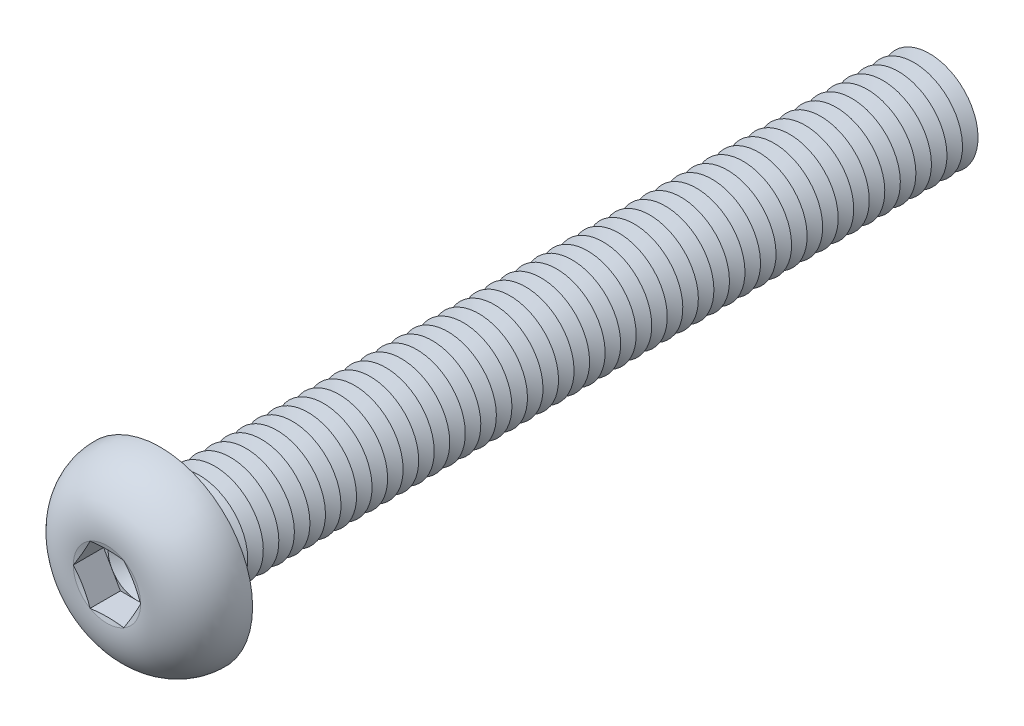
ISO-10303-21;
HEADER;
FILE_DESCRIPTION(('STEP AP214'),'2;1');
FILE_NAME('part.step','',(''),(''),'','','');
FILE_SCHEMA(('AUTOMOTIVE_DESIGN { 1 0 10303 214 1 1 1 1 }'));
ENDSEC;
DATA;
#1=APPLICATION_CONTEXT('core data for automotive mechanical design processes');
#2=APPLICATION_PROTOCOL_DEFINITION('international standard','automotive_design',2000,#1);
#3=PRODUCT_CONTEXT('',#1,'mechanical');
#4=PRODUCT('Part','Part','',(#3));
#5=PRODUCT_RELATED_PRODUCT_CATEGORY('part','',(#4));
#6=PRODUCT_DEFINITION_FORMATION('','',#4);
#7=PRODUCT_DEFINITION_CONTEXT('part definition',#1,'design');
#8=PRODUCT_DEFINITION('design','',#6,#7);
#9=PRODUCT_DEFINITION_SHAPE('','',#8);
#10=(LENGTH_UNIT() NAMED_UNIT(*) SI_UNIT(.MILLI.,.METRE.));
#11=(NAMED_UNIT(*) PLANE_ANGLE_UNIT() SI_UNIT($,.RADIAN.));
#12=(NAMED_UNIT(*) SI_UNIT($,.STERADIAN.) SOLID_ANGLE_UNIT());
#13=UNCERTAINTY_MEASURE_WITH_UNIT(LENGTH_MEASURE(1.E-05),#10,'distance_accuracy_value','');
#14=(GEOMETRIC_REPRESENTATION_CONTEXT(3) GLOBAL_UNCERTAINTY_ASSIGNED_CONTEXT((#13)) GLOBAL_UNIT_ASSIGNED_CONTEXT((#10,
#11,#12)) REPRESENTATION_CONTEXT('',''));
#15=CARTESIAN_POINT('',(0.,0.,0.));
#16=DIRECTION('',(0.,0.,1.));
#17=DIRECTION('',(1.,0.,0.));
#18=AXIS2_PLACEMENT_3D('',#15,#16,#17);
#19=CARTESIAN_POINT('',(0.,0.,1.19));
#20=DIRECTION('',(0.,0.,1.));
#21=DIRECTION('',(1.,0.,0.));
#22=AXIS2_PLACEMENT_3D('',#19,#20,#21);
#23=PLANE('',#22);
#24=CARTESIAN_POINT('',(0.,0.,1.19));
#25=DIRECTION('',(0.,0.,1.));
#26=DIRECTION('',(1.,0.,0.));
#27=AXIS2_PLACEMENT_3D('',#24,#25,#26);
#28=CIRCLE('',#27,1.49999930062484);
#29=CARTESIAN_POINT('',(1.2990375,0.749999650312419,1.19));
#30=VERTEX_POINT('',#29);
#31=CARTESIAN_POINT('',(0.,1.49999930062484,1.19));
#32=VERTEX_POINT('',#31);
#33=EDGE_CURVE('E118',#30,#32,#28,.T.);
#34=ORIENTED_EDGE('',*,*,#33,.F.);
#35=DIRECTION('',(-0.5,0.866025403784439,0.));
#36=VECTOR('',#35,1.);
#37=CARTESIAN_POINT('',(1.73205,0.,1.19));
#38=LINE('',#37,#36);
#39=CARTESIAN_POINT('',(0.866025,1.49999930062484,1.19));
#40=VERTEX_POINT('',#39);
#41=EDGE_CURVE('E125',#30,#40,#38,.T.);
#42=ORIENTED_EDGE('',*,*,#41,.T.);
#43=DIRECTION('',(-1.,0.,0.));
#44=VECTOR('',#43,1.);
#45=CARTESIAN_POINT('',(0.866025,1.49999930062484,1.19));
#46=LINE('',#45,#44);
#47=EDGE_CURVE('E136',#40,#32,#46,.T.);
#48=ORIENTED_EDGE('',*,*,#47,.T.);
#49=EDGE_LOOP('',(#34,#42,#48));
#50=FACE_BOUND('',#49,.T.);
#51=ADVANCED_FACE('F39',(#50),#23,.T.);
#52=CARTESIAN_POINT('',(0.,0.,1.19));
#53=DIRECTION('',(0.,0.,1.));
#54=DIRECTION('',(1.,0.,0.));
#55=AXIS2_PLACEMENT_3D('',#52,#53,#54);
#56=CIRCLE('',#55,1.49999930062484);
#57=CARTESIAN_POINT('',(-1.2990375,0.749999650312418,1.19));
#58=VERTEX_POINT('',#57);
#59=EDGE_CURVE('E11',#32,#58,#56,.T.);
#60=ORIENTED_EDGE('',*,*,#59,.F.);
#61=CARTESIAN_POINT('',(-0.866025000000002,1.49999930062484,1.19));
#62=VERTEX_POINT('',#61);
#63=EDGE_CURVE('E131',#32,#62,#46,.T.);
#64=ORIENTED_EDGE('',*,*,#63,.T.);
#65=DIRECTION('',(-0.5,-0.866025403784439,0.));
#66=VECTOR('',#65,1.);
#67=CARTESIAN_POINT('',(-0.866025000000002,1.49999930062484,1.19));
#68=LINE('',#67,#66);
#69=EDGE_CURVE('E134',#62,#58,#68,.T.);
#70=ORIENTED_EDGE('',*,*,#69,.T.);
#71=EDGE_LOOP('',(#60,#64,#70));
#72=FACE_BOUND('',#71,.T.);
#73=ADVANCED_FACE('F130',(#72),#23,.T.);
#74=CARTESIAN_POINT('',(-1.2990375,-0.749999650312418,1.19));
#75=VERTEX_POINT('',#74);
#76=EDGE_CURVE('E49',#58,#75,#56,.T.);
#77=ORIENTED_EDGE('',*,*,#76,.F.);
#78=CARTESIAN_POINT('',(-1.73205,0.,1.19));
#79=VERTEX_POINT('',#78);
#80=EDGE_CURVE('E143',#58,#79,#68,.T.);
#81=ORIENTED_EDGE('',*,*,#80,.T.);
#82=DIRECTION('',(0.5,-0.866025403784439,0.));
#83=VECTOR('',#82,1.);
#84=CARTESIAN_POINT('',(-1.73205,0.,1.19));
#85=LINE('',#84,#83);
#86=EDGE_CURVE('E151',#79,#75,#85,.T.);
#87=ORIENTED_EDGE('',*,*,#86,.T.);
#88=EDGE_LOOP('',(#77,#81,#87));
#89=FACE_BOUND('',#88,.T.);
#90=ADVANCED_FACE('F666',(#89),#23,.T.);
#91=CARTESIAN_POINT('',(0.,-1.49999930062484,1.19));
#92=VERTEX_POINT('',#91);
#93=EDGE_CURVE('E650',#75,#92,#56,.T.);
#94=ORIENTED_EDGE('',*,*,#93,.F.);
#95=CARTESIAN_POINT('',(-0.866025,-1.49999930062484,1.19));
#96=VERTEX_POINT('',#95);
#97=EDGE_CURVE('E150',#75,#96,#85,.T.);
#98=ORIENTED_EDGE('',*,*,#97,.T.);
#99=DIRECTION('',(1.,0.,0.));
#100=VECTOR('',#99,1.);
#101=CARTESIAN_POINT('',(-0.866025,-1.49999930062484,1.19));
#102=LINE('',#101,#100);
#103=EDGE_CURVE('E156',#96,#92,#102,.T.);
#104=ORIENTED_EDGE('',*,*,#103,.T.);
#105=EDGE_LOOP('',(#94,#98,#104));
#106=FACE_BOUND('',#105,.T.);
#107=ADVANCED_FACE('F659',(#106),#23,.T.);
#108=CARTESIAN_POINT('',(1.2990375,-0.749999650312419,1.19));
#109=VERTEX_POINT('',#108);
#110=EDGE_CURVE('E56',#92,#109,#56,.T.);
#111=ORIENTED_EDGE('',*,*,#110,.F.);
#112=CARTESIAN_POINT('',(0.866025,-1.49999930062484,1.19));
#113=VERTEX_POINT('',#112);
#114=EDGE_CURVE('E155',#92,#113,#102,.T.);
#115=ORIENTED_EDGE('',*,*,#114,.T.);
#116=DIRECTION('',(0.5,0.866025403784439,0.));
#117=VECTOR('',#116,1.);
#118=CARTESIAN_POINT('',(0.866025,-1.49999930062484,1.19));
#119=LINE('',#118,#117);
#120=EDGE_CURVE('E161',#113,#109,#119,.T.);
#121=ORIENTED_EDGE('',*,*,#120,.T.);
#122=EDGE_LOOP('',(#111,#115,#121));
#123=FACE_BOUND('',#122,.T.);
#124=ADVANCED_FACE('F736',(#123),#23,.T.);
#125=CARTESIAN_POINT('',(0.,0.,2.75));
#126=DIRECTION('',(0.,0.,1.));
#127=DIRECTION('',(0.,-1.,0.));
#128=AXIS2_PLACEMENT_3D('',#125,#126,#127);
#129=CONICAL_SURFACE('',#128,1.73205,1.30899693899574);
#130=CARTESIAN_POINT('',(1.73216547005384,-0.00020000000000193,2.75003094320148));
#131=CARTESIAN_POINT('',(1.69619207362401,0.0621077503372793,2.74038633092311));
#132=CARTESIAN_POINT('',(1.66015343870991,0.124528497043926,2.73163050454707));
#133=CARTESIAN_POINT('',(1.58794885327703,0.249590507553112,2.71624720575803));
#134=CARTESIAN_POINT('',(1.5517828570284,0.312231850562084,2.7096205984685));
#135=CARTESIAN_POINT('',(1.47954289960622,0.437355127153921,2.69888271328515));
#136=CARTESIAN_POINT('',(1.4434694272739,0.499836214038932,2.69475862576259));
#137=CARTESIAN_POINT('',(1.37127646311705,0.624878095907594,2.68922863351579));
#138=CARTESIAN_POINT('',(1.33515698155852,0.687438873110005,2.68782220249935));
#139=CARTESIAN_POINT('',(1.26291801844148,0.812560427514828,2.68782220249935));
#140=CARTESIAN_POINT('',(1.22679853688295,0.875121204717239,2.68922863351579));
#141=CARTESIAN_POINT('',(1.1546055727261,1.0001630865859,2.69475862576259));
#142=CARTESIAN_POINT('',(1.11853210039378,1.06264417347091,2.69888271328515));
#143=CARTESIAN_POINT('',(1.0462921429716,1.18776745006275,2.7096205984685));
#144=CARTESIAN_POINT('',(1.01012614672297,1.25040879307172,2.71624720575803));
#145=CARTESIAN_POINT('',(0.937921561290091,1.37547080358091,2.73163050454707));
#146=CARTESIAN_POINT('',(0.901882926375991,1.43789155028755,2.74038633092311));
#147=CARTESIAN_POINT('',(0.865909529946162,1.50019930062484,2.75003094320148));
#148=B_SPLINE_CURVE_WITH_KNOTS('',3,(#130,#131,#132,#133,#134,#135,#136,#137,#138,#139,#140,
#141,#142,#143,#144,#145,#146,#147),.UNSPECIFIED.,.F.,.F.,(4,2,2,2,2,2,2,2,4),(0.,
0.217782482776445,0.435653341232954,0.652399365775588,0.869103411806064,1.08580745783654,
1.30255348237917,1.52042434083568,1.73820682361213),.UNSPECIFIED.);
#149=CARTESIAN_POINT('',(1.73205,0.,2.75));
#150=VERTEX_POINT('',#149);
#151=CARTESIAN_POINT('',(0.866025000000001,1.49999930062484,2.75));
#152=VERTEX_POINT('',#151);
#153=EDGE_CURVE('E220',#150,#152,#148,.T.);
#154=ORIENTED_EDGE('',*,*,#153,.F.);
#155=CARTESIAN_POINT('',(0.,0.,2.75));
#156=DIRECTION('',(0.,0.,-1.));
#157=DIRECTION('',(0.,1.,0.));
#158=AXIS2_PLACEMENT_3D('',#155,#156,#157);
#159=CIRCLE('',#158,1.73205);
#160=EDGE_CURVE('E635',#152,#150,#159,.T.);
#161=ORIENTED_EDGE('',*,*,#160,.F.);
#162=EDGE_LOOP('',(#154,#161));
#163=FACE_BOUND('',#162,.T.);
#164=ADVANCED_FACE('F740',(#163),#129,.F.);
#165=CARTESIAN_POINT('',(0.865909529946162,-1.50019930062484,2.75003094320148));
#166=CARTESIAN_POINT('',(0.901882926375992,-1.43789155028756,2.74038633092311));
#167=CARTESIAN_POINT('',(0.937921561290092,-1.37547080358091,2.73163050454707));
#168=CARTESIAN_POINT('',(1.01012614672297,-1.25040879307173,2.71624720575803));
#169=CARTESIAN_POINT('',(1.0462921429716,-1.18776745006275,2.7096205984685));
#170=CARTESIAN_POINT('',(1.11853210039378,-1.06264417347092,2.69888271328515));
#171=CARTESIAN_POINT('',(1.1546055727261,-1.00016308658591,2.69475862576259));
#172=CARTESIAN_POINT('',(1.22679853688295,-0.875121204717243,2.68922863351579));
#173=CARTESIAN_POINT('',(1.26291801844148,-0.812560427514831,2.68782220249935));
#174=CARTESIAN_POINT('',(1.33515698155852,-0.687438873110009,2.68782220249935));
#175=CARTESIAN_POINT('',(1.37127646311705,-0.624878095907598,2.68922863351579));
#176=CARTESIAN_POINT('',(1.4434694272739,-0.499836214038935,2.69475862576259));
#177=CARTESIAN_POINT('',(1.47954289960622,-0.437355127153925,2.69888271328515));
#178=CARTESIAN_POINT('',(1.5517828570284,-0.312231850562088,2.7096205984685));
#179=CARTESIAN_POINT('',(1.58794885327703,-0.249590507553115,2.71624720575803));
#180=CARTESIAN_POINT('',(1.66015343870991,-0.12452849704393,2.73163050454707));
#181=CARTESIAN_POINT('',(1.69619207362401,-0.0621077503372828,2.74038633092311));
#182=CARTESIAN_POINT('',(1.73216547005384,0.000199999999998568,2.75003094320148));
#183=B_SPLINE_CURVE_WITH_KNOTS('',3,(#165,#166,#167,#168,#169,#170,#171,#172,#173,#174,#175,
#176,#177,#178,#179,#180,#181,#182),.UNSPECIFIED.,.F.,.F.,(4,2,2,2,2,2,2,2,4),(0.,
0.217782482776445,0.435653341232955,0.652399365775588,0.869103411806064,1.08580745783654,
1.30255348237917,1.52042434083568,1.73820682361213),.UNSPECIFIED.);
#184=CARTESIAN_POINT('',(0.866025,-1.49999930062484,2.75));
#185=VERTEX_POINT('',#184);
#186=EDGE_CURVE('E229',#185,#150,#183,.T.);
#187=ORIENTED_EDGE('',*,*,#186,.F.);
#188=EDGE_CURVE('E640',#150,#185,#159,.T.);
#189=ORIENTED_EDGE('',*,*,#188,.F.);
#190=EDGE_LOOP('',(#187,#189));
#191=FACE_BOUND('',#190,.T.);
#192=ADVANCED_FACE('F702',(#191),#129,.F.);
#193=CARTESIAN_POINT('',(-2.61375031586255,-1.49999930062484,3.09338600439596));
#194=CARTESIAN_POINT('',(-2.48719895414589,-1.49999930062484,3.06401688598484));
#195=CARTESIAN_POINT('',(-2.36054180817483,-1.49999930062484,3.03507426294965));
#196=CARTESIAN_POINT('',(-2.10688190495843,-1.49999930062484,2.97862489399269));
#197=CARTESIAN_POINT('',(-1.97987908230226,-1.49999930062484,2.95111844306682));
#198=CARTESIAN_POINT('',(-1.72425281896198,-1.49999930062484,2.89788845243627));
#199=CARTESIAN_POINT('',(-1.59562534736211,-1.49999930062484,2.87218404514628));
#200=CARTESIAN_POINT('',(-1.33776732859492,-1.49999930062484,2.82387586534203));
#201=CARTESIAN_POINT('',(-1.20853672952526,-1.49999930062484,2.80127236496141));
#202=CARTESIAN_POINT('',(-0.952831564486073,-1.49999930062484,2.76126658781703));
#203=CARTESIAN_POINT('',(-0.826376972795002,-1.49999930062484,2.74374018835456));
#204=CARTESIAN_POINT('',(-0.572755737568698,-1.49999930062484,2.71502809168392));
#205=CARTESIAN_POINT('',(-0.44558933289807,-1.49999930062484,2.70384038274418));
#206=CARTESIAN_POINT('',(-0.191333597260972,-1.49999930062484,2.68972083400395));
#207=CARTESIAN_POINT('',(-0.0642464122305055,-1.49999930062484,2.68675270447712));
#208=CARTESIAN_POINT('',(0.189835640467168,-1.49999930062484,2.68959577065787));
#209=CARTESIAN_POINT('',(0.316830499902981,-1.49999930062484,2.69540767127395));
#210=CARTESIAN_POINT('',(0.534182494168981,-1.49999930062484,2.71190493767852));
#211=CARTESIAN_POINT('',(0.624691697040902,-1.49999930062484,2.72073513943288));
#212=CARTESIAN_POINT('',(0.805336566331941,-1.49999930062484,2.74156379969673));
#213=CARTESIAN_POINT('',(0.895472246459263,-1.49999930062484,2.75356214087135));
#214=CARTESIAN_POINT('',(1.0756572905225,-1.49999930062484,2.78006977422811));
#215=CARTESIAN_POINT('',(1.16570548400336,-1.49999930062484,2.7945868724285));
#216=CARTESIAN_POINT('',(1.3454787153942,-1.49999930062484,2.82550612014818));
#217=CARTESIAN_POINT('',(1.43520373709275,-1.49999930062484,2.8419083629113));
#218=CARTESIAN_POINT('',(1.61622412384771,-1.49999930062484,2.87648604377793));
#219=CARTESIAN_POINT('',(1.70751379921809,-1.49999930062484,2.89469103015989));
#220=CARTESIAN_POINT('',(1.88986344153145,-1.49999930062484,2.93221618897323));
#221=CARTESIAN_POINT('',(1.98092340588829,-1.49999930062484,2.95153637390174));
#222=CARTESIAN_POINT('',(2.16236354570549,-1.49999930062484,2.99091506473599));
#223=CARTESIAN_POINT('',(2.25274472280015,-1.49999930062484,3.01096897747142));
#224=CARTESIAN_POINT('',(2.43335289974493,-1.49999930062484,3.05173139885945));
#225=CARTESIAN_POINT('',(2.52357990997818,-1.49999930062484,3.07243986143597));
#226=CARTESIAN_POINT('',(2.61375031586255,-1.49999930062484,3.09338600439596));
#227=B_SPLINE_CURVE_WITH_KNOTS('',3,(#193,#194,#195,#196,#197,#198,#199,#200,#201,#202,#203,
#204,#205,#206,#207,#208,#209,#210,#211,#212,#213,#214,#215,#216,#217,#218,#219,#220,#221,#222,
#223,#224,#225,#226),.UNSPECIFIED.,.F.,.F.,(4,2,2,2,2,2,2,2,2,2,2,2,2,2,2,2,4),(0.,
0.389753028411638,0.779585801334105,1.17307326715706,1.5665952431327,1.94947555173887,
2.33223427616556,2.71330039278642,3.09439710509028,3.36715350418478,3.63989980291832,
3.91350699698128,4.18712773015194,4.4663802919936,4.74563598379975,5.02337106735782,
5.3010866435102),.UNSPECIFIED.);
#228=CARTESIAN_POINT('',(-0.866025,-1.49999930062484,2.75));
#229=VERTEX_POINT('',#228);
#230=EDGE_CURVE('E680',#229,#185,#227,.T.);
#231=ORIENTED_EDGE('',*,*,#230,.F.);
#232=EDGE_CURVE('E693',#185,#229,#159,.T.);
#233=ORIENTED_EDGE('',*,*,#232,.F.);
#234=EDGE_LOOP('',(#231,#233));
#235=FACE_BOUND('',#234,.T.);
#236=ADVANCED_FACE('F708',(#235),#129,.F.);
#237=CARTESIAN_POINT('',(-1.73216547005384,0.000199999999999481,2.75003094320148));
#238=CARTESIAN_POINT('',(-1.69619207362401,-0.0621077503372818,2.74038633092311));
#239=CARTESIAN_POINT('',(-1.66015343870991,-0.124528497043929,2.73163050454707));
#240=CARTESIAN_POINT('',(-1.58794885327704,-0.249590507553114,2.71624720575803));
#241=CARTESIAN_POINT('',(-1.55178285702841,-0.312231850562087,2.7096205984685));
#242=CARTESIAN_POINT('',(-1.47954289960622,-0.437355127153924,2.69888271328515));
#243=CARTESIAN_POINT('',(-1.4434694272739,-0.499836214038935,2.69475862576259));
#244=CARTESIAN_POINT('',(-1.37127646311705,-0.624878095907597,2.68922863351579));
#245=CARTESIAN_POINT('',(-1.33515698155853,-0.687438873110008,2.68782220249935));
#246=CARTESIAN_POINT('',(-1.26291801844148,-0.812560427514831,2.68782220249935));
#247=CARTESIAN_POINT('',(-1.22679853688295,-0.875121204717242,2.68922863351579));
#248=CARTESIAN_POINT('',(-1.1546055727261,-1.0001630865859,2.69475862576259));
#249=CARTESIAN_POINT('',(-1.11853210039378,-1.06264417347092,2.69888271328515));
#250=CARTESIAN_POINT('',(-1.0462921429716,-1.18776745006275,2.7096205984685));
#251=CARTESIAN_POINT('',(-1.01012614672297,-1.25040879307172,2.71624720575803));
#252=CARTESIAN_POINT('',(-0.937921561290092,-1.37547080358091,2.73163050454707));
#253=CARTESIAN_POINT('',(-0.901882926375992,-1.43789155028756,2.74038633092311));
#254=CARTESIAN_POINT('',(-0.865909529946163,-1.50019930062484,2.75003094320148));
#255=B_SPLINE_CURVE_WITH_KNOTS('',3,(#237,#238,#239,#240,#241,#242,#243,#244,#245,#246,#247,
#248,#249,#250,#251,#252,#253,#254),.UNSPECIFIED.,.F.,.F.,(4,2,2,2,2,2,2,2,4),(0.,
0.217782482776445,0.435653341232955,0.652399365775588,0.869103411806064,1.08580745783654,
1.30255348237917,1.52042434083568,1.73820682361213),.UNSPECIFIED.);
#256=CARTESIAN_POINT('',(-1.73205,0.,2.75));
#257=VERTEX_POINT('',#256);
#258=EDGE_CURVE('E671',#257,#229,#255,.T.);
#259=ORIENTED_EDGE('',*,*,#258,.F.);
#260=EDGE_CURVE('E677',#229,#257,#159,.T.);
#261=ORIENTED_EDGE('',*,*,#260,.F.);
#262=EDGE_LOOP('',(#259,#261));
#263=FACE_BOUND('',#262,.T.);
#264=ADVANCED_FACE('F675',(#263),#129,.F.);
#265=CARTESIAN_POINT('',(-0.865909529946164,1.50019930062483,2.75003094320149));
#266=CARTESIAN_POINT('',(-0.901882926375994,1.43789155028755,2.74038633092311));
#267=CARTESIAN_POINT('',(-0.937921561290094,1.37547080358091,2.73163050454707));
#268=CARTESIAN_POINT('',(-1.01012614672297,1.25040879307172,2.71624720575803));
#269=CARTESIAN_POINT('',(-1.0462921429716,1.18776745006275,2.7096205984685));
#270=CARTESIAN_POINT('',(-1.11853210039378,1.06264417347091,2.69888271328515));
#271=CARTESIAN_POINT('',(-1.1546055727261,1.0001630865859,2.69475862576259));
#272=CARTESIAN_POINT('',(-1.22679853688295,0.87512120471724,2.68922863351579));
#273=CARTESIAN_POINT('',(-1.26291801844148,0.812560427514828,2.68782220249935));
#274=CARTESIAN_POINT('',(-1.33515698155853,0.687438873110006,2.68782220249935));
#275=CARTESIAN_POINT('',(-1.37127646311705,0.624878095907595,2.68922863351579));
#276=CARTESIAN_POINT('',(-1.4434694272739,0.499836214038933,2.69475862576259));
#277=CARTESIAN_POINT('',(-1.47954289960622,0.437355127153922,2.69888271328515));
#278=CARTESIAN_POINT('',(-1.55178285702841,0.312231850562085,2.7096205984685));
#279=CARTESIAN_POINT('',(-1.58794885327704,0.249590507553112,2.71624720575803));
#280=CARTESIAN_POINT('',(-1.66015343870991,0.124528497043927,2.73163050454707));
#281=CARTESIAN_POINT('',(-1.69619207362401,0.0621077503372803,2.74038633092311));
#282=CARTESIAN_POINT('',(-1.73216547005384,-0.000200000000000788,2.75003094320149));
#283=B_SPLINE_CURVE_WITH_KNOTS('',3,(#265,#266,#267,#268,#269,#270,#271,#272,#273,#274,#275,
#276,#277,#278,#279,#280,#281,#282),.UNSPECIFIED.,.F.,.F.,(4,2,2,2,2,2,2,2,4),(0.,
0.217782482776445,0.435653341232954,0.652399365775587,0.869103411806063,1.08580745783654,
1.30255348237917,1.52042434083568,1.73820682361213),.UNSPECIFIED.);
#284=CARTESIAN_POINT('',(-0.866025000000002,1.49999930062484,2.75));
#285=VERTEX_POINT('',#284);
#286=EDGE_CURVE('E194',#285,#257,#283,.T.);
#287=ORIENTED_EDGE('',*,*,#286,.F.);
#288=EDGE_CURVE('E683',#257,#285,#159,.T.);
#289=ORIENTED_EDGE('',*,*,#288,.F.);
#290=EDGE_LOOP('',(#287,#289));
#291=FACE_BOUND('',#290,.T.);
#292=ADVANCED_FACE('F684',(#291),#129,.F.);
#293=CARTESIAN_POINT('',(0.,0.,-37.2));
#294=DIRECTION('',(0.,0.,1.));
#295=DIRECTION('',(0.,-1.,0.));
#296=AXIS2_PLACEMENT_3D('',#293,#294,#295);
#297=CONICAL_SURFACE('',#296,2.49999999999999,1.0471975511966);
#298=CARTESIAN_POINT('',(0.,0.,-37.6));
#299=DIRECTION('',(0.,0.,1.));
#300=DIRECTION('',(0.,-1.,0.));
#301=AXIS2_PLACEMENT_3D('',#298,#299,#300);
#302=CIRCLE('',#301,1.80717967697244);
#303=CARTESIAN_POINT('',(0.,-1.80717967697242,-37.6));
#304=VERTEX_POINT('',#303);
#305=EDGE_CURVE('E606',#304,#304,#302,.T.);
#306=ORIENTED_EDGE('',*,*,#305,.T.);
#307=EDGE_LOOP('',(#306));
#308=FACE_BOUND('',#307,.T.);
#309=CARTESIAN_POINT('',(0.,0.,-37.2));
#310=DIRECTION('',(0.,0.,1.));
#311=DIRECTION('',(0.,-1.,0.));
#312=AXIS2_PLACEMENT_3D('',#309,#310,#311);
#313=CIRCLE('',#312,2.49999999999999);
#314=CARTESIAN_POINT('',(0.,-2.49999999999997,-37.2));
#315=VERTEX_POINT('',#314);
#316=EDGE_CURVE('E602',#315,#315,#313,.T.);
#317=ORIENTED_EDGE('',*,*,#316,.F.);
#318=EDGE_LOOP('',(#317));
#319=FACE_BOUND('',#318,.T.);
#320=ADVANCED_FACE('F769',(#308,#319),#297,.T.);
#321=CARTESIAN_POINT('',(0.,0.,-37.6));
#322=DIRECTION('',(0.,0.,-1.));
#323=DIRECTION('',(0.,1.,0.));
#324=AXIS2_PLACEMENT_3D('',#321,#322,#323);
#325=CONICAL_SURFACE('',#324,1.80717967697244,1.04719755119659);
#326=CARTESIAN_POINT('',(0.,0.,-38.));
#327=DIRECTION('',(0.,0.,1.));
#328=DIRECTION('',(0.,-1.,0.));
#329=AXIS2_PLACEMENT_3D('',#326,#327,#328);
#330=CIRCLE('',#329,2.49999999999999);
#331=CARTESIAN_POINT('',(0.,-2.49999999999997,-38.));
#332=VERTEX_POINT('',#331);
#333=EDGE_CURVE('E610',#332,#332,#330,.T.);
#334=ORIENTED_EDGE('',*,*,#333,.T.);
#335=EDGE_LOOP('',(#334));
#336=FACE_BOUND('',#335,.T.);
#337=ORIENTED_EDGE('',*,*,#305,.F.);
#338=EDGE_LOOP('',(#337));
#339=FACE_BOUND('',#338,.T.);
#340=ADVANCED_FACE('F774',(#336,#339),#325,.T.);
#341=CARTESIAN_POINT('',(0.,2.5,-40.));
#342=DIRECTION('',(0.,0.,-1.));
#343=DIRECTION('',(0.,1.,0.));
#344=AXIS2_PLACEMENT_3D('',#341,#342,#343);
#345=PLANE('',#344);
#346=CARTESIAN_POINT('',(0.,0.,-40.));
#347=DIRECTION('',(0.,0.,1.));
#348=DIRECTION('',(0.,-1.,0.));
#349=AXIS2_PLACEMENT_3D('',#346,#347,#348);
#350=CIRCLE('',#349,1.80717967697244);
#351=CARTESIAN_POINT('',(0.,-1.80717967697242,-40.));
#352=VERTEX_POINT('',#351);
#353=EDGE_CURVE('E630',#352,#352,#350,.T.);
#354=ORIENTED_EDGE('',*,*,#353,.F.);
#355=EDGE_LOOP('',(#354));
#356=FACE_BOUND('',#355,.T.);
#357=ADVANCED_FACE('F941',(#356),#345,.T.);
#358=CARTESIAN_POINT('',(0.,0.,-39.6));
#359=DIRECTION('',(0.,0.,1.));
#360=DIRECTION('',(0.,-1.,0.));
#361=AXIS2_PLACEMENT_3D('',#358,#359,#360);
#362=CONICAL_SURFACE('',#361,2.49999999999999,1.0471975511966);
#363=ORIENTED_EDGE('',*,*,#353,.T.);
#364=EDGE_LOOP('',(#363));
#365=FACE_BOUND('',#364,.T.);
#366=CARTESIAN_POINT('',(0.,0.,-39.6));
#367=DIRECTION('',(0.,0.,1.));
#368=DIRECTION('',(0.,-1.,0.));
#369=AXIS2_PLACEMENT_3D('',#366,#367,#368);
#370=CIRCLE('',#369,2.49999999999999);
#371=CARTESIAN_POINT('',(0.,-2.49999999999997,-39.6));
#372=VERTEX_POINT('',#371);
#373=EDGE_CURVE('E626',#372,#372,#370,.T.);
#374=ORIENTED_EDGE('',*,*,#373,.F.);
#375=EDGE_LOOP('',(#374));
#376=FACE_BOUND('',#375,.T.);
#377=ADVANCED_FACE('F934',(#365,#376),#362,.T.);
#378=CARTESIAN_POINT('',(0.,0.,-39.2));
#379=DIRECTION('',(0.,0.,-1.));
#380=DIRECTION('',(0.,1.,0.));
#381=AXIS2_PLACEMENT_3D('',#378,#379,#380);
#382=CONICAL_SURFACE('',#381,1.80717967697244,1.04719755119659);
#383=ORIENTED_EDGE('',*,*,#373,.T.);
#384=EDGE_LOOP('',(#383));
#385=FACE_BOUND('',#384,.T.);
#386=CARTESIAN_POINT('',(0.,0.,-39.2));
#387=DIRECTION('',(0.,0.,1.));
#388=DIRECTION('',(0.,-1.,0.));
#389=AXIS2_PLACEMENT_3D('',#386,#387,#388);
#390=CIRCLE('',#389,1.80717967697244);
#391=CARTESIAN_POINT('',(0.,-1.80717967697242,-39.2));
#392=VERTEX_POINT('',#391);
#393=EDGE_CURVE('E622',#392,#392,#390,.T.);
#394=ORIENTED_EDGE('',*,*,#393,.F.);
#395=EDGE_LOOP('',(#394));
#396=FACE_BOUND('',#395,.T.);
#397=ADVANCED_FACE('F940',(#385,#396),#382,.T.);
#398=CARTESIAN_POINT('',(0.,0.,-38.8));
#399=DIRECTION('',(0.,0.,1.));
#400=DIRECTION('',(0.,-1.,0.));
#401=AXIS2_PLACEMENT_3D('',#398,#399,#400);
#402=CONICAL_SURFACE('',#401,2.49999999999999,1.0471975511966);
#403=ORIENTED_EDGE('',*,*,#393,.T.);
#404=EDGE_LOOP('',(#403));
#405=FACE_BOUND('',#404,.T.);
#406=CARTESIAN_POINT('',(0.,0.,-38.8));
#407=DIRECTION('',(0.,0.,1.));
#408=DIRECTION('',(0.,-1.,0.));
#409=AXIS2_PLACEMENT_3D('',#406,#407,#408);
#410=CIRCLE('',#409,2.49999999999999);
#411=CARTESIAN_POINT('',(0.,-2.49999999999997,-38.8));
#412=VERTEX_POINT('',#411);
#413=EDGE_CURVE('E618',#412,#412,#410,.T.);
#414=ORIENTED_EDGE('',*,*,#413,.F.);
#415=EDGE_LOOP('',(#414));
#416=FACE_BOUND('',#415,.T.);
#417=ADVANCED_FACE('F972',(#405,#416),#402,.T.);
#418=CARTESIAN_POINT('',(0.,0.,-38.4));
#419=DIRECTION('',(0.,0.,-1.));
#420=DIRECTION('',(0.,1.,0.));
#421=AXIS2_PLACEMENT_3D('',#418,#419,#420);
#422=CONICAL_SURFACE('',#421,1.80717967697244,1.04719755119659);
#423=ORIENTED_EDGE('',*,*,#413,.T.);
#424=EDGE_LOOP('',(#423));
#425=FACE_BOUND('',#424,.T.);
#426=CARTESIAN_POINT('',(0.,0.,-38.4));
#427=DIRECTION('',(0.,0.,1.));
#428=DIRECTION('',(0.,-1.,0.));
#429=AXIS2_PLACEMENT_3D('',#426,#427,#428);
#430=CIRCLE('',#429,1.80717967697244);
#431=CARTESIAN_POINT('',(0.,-1.80717967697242,-38.4));
#432=VERTEX_POINT('',#431);
#433=EDGE_CURVE('E614',#432,#432,#430,.T.);
#434=ORIENTED_EDGE('',*,*,#433,.F.);
#435=EDGE_LOOP('',(#434));
#436=FACE_BOUND('',#435,.T.);
#437=ADVANCED_FACE('F982',(#425,#436),#422,.T.);
#438=CARTESIAN_POINT('',(0.,0.,-38.));
#439=DIRECTION('',(0.,0.,1.));
#440=DIRECTION('',(0.,-1.,0.));
#441=AXIS2_PLACEMENT_3D('',#438,#439,#440);
#442=CONICAL_SURFACE('',#441,2.49999999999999,1.0471975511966);
#443=ORIENTED_EDGE('',*,*,#433,.T.);
#444=EDGE_LOOP('',(#443));
#445=FACE_BOUND('',#444,.T.);
#446=ORIENTED_EDGE('',*,*,#333,.F.);
#447=EDGE_LOOP('',(#446));
#448=FACE_BOUND('',#447,.T.);
#449=ADVANCED_FACE('F992',(#445,#448),#442,.T.);
#450=CARTESIAN_POINT('',(0.,0.,-36.4));
#451=DIRECTION('',(0.,0.,1.));
#452=DIRECTION('',(0.,-1.,0.));
#453=AXIS2_PLACEMENT_3D('',#450,#451,#452);
#454=CONICAL_SURFACE('',#453,2.49999999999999,1.0471975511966);
#455=CARTESIAN_POINT('',(0.,0.,-36.8));
#456=DIRECTION('',(0.,0.,1.));
#457=DIRECTION('',(0.,-1.,0.));
#458=AXIS2_PLACEMENT_3D('',#455,#456,#457);
#459=CIRCLE('',#458,1.80717967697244);
#460=CARTESIAN_POINT('',(0.,-1.80717967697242,-36.8));
#461=VERTEX_POINT('',#460);
#462=EDGE_CURVE('E598',#461,#461,#459,.T.);
#463=ORIENTED_EDGE('',*,*,#462,.T.);
#464=EDGE_LOOP('',(#463));
#465=FACE_BOUND('',#464,.T.);
#466=CARTESIAN_POINT('',(0.,0.,-36.4));
#467=DIRECTION('',(0.,0.,1.));
#468=DIRECTION('',(0.,-1.,0.));
#469=AXIS2_PLACEMENT_3D('',#466,#467,#468);
#470=CIRCLE('',#469,2.49999999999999);
#471=CARTESIAN_POINT('',(0.,-2.49999999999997,-36.4));
#472=VERTEX_POINT('',#471);
#473=EDGE_CURVE('E594',#472,#472,#470,.T.);
#474=ORIENTED_EDGE('',*,*,#473,.F.);
#475=EDGE_LOOP('',(#474));
#476=FACE_BOUND('',#475,.T.);
#477=ADVANCED_FACE('F1002',(#465,#476),#454,.T.);
#478=CARTESIAN_POINT('',(0.,0.,-36.8));
#479=DIRECTION('',(0.,0.,-1.));
#480=DIRECTION('',(0.,1.,0.));
#481=AXIS2_PLACEMENT_3D('',#478,#479,#480);
#482=CONICAL_SURFACE('',#481,1.80717967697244,1.04719755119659);
#483=ORIENTED_EDGE('',*,*,#316,.T.);
#484=EDGE_LOOP('',(#483));
#485=FACE_BOUND('',#484,.T.);
#486=ORIENTED_EDGE('',*,*,#462,.F.);
#487=EDGE_LOOP('',(#486));
#488=FACE_BOUND('',#487,.T.);
#489=ADVANCED_FACE('F1012',(#485,#488),#482,.T.);
#490=CARTESIAN_POINT('',(0.,0.,-35.6));
#491=DIRECTION('',(0.,0.,1.));
#492=DIRECTION('',(0.,-1.,0.));
#493=AXIS2_PLACEMENT_3D('',#490,#491,#492);
#494=CONICAL_SURFACE('',#493,2.49999999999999,1.0471975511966);
#495=CARTESIAN_POINT('',(0.,0.,-36.));
#496=DIRECTION('',(0.,0.,1.));
#497=DIRECTION('',(0.,-1.,0.));
#498=AXIS2_PLACEMENT_3D('',#495,#496,#497);
#499=CIRCLE('',#498,1.80717967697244);
#500=CARTESIAN_POINT('',(0.,-1.80717967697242,-36.));
#501=VERTEX_POINT('',#500);
#502=EDGE_CURVE('E590',#501,#501,#499,.T.);
#503=ORIENTED_EDGE('',*,*,#502,.T.);
#504=EDGE_LOOP('',(#503));
#505=FACE_BOUND('',#504,.T.);
#506=CARTESIAN_POINT('',(0.,0.,-35.6));
#507=DIRECTION('',(0.,0.,1.));
#508=DIRECTION('',(0.,-1.,0.));
#509=AXIS2_PLACEMENT_3D('',#506,#507,#508);
#510=CIRCLE('',#509,2.49999999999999);
#511=CARTESIAN_POINT('',(0.,-2.49999999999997,-35.6));
#512=VERTEX_POINT('',#511);
#513=EDGE_CURVE('E586',#512,#512,#510,.T.);
#514=ORIENTED_EDGE('',*,*,#513,.F.);
#515=EDGE_LOOP('',(#514));
#516=FACE_BOUND('',#515,.T.);
#517=ADVANCED_FACE('F1022',(#505,#516),#494,.T.);
#518=CARTESIAN_POINT('',(0.,0.,-36.));
#519=DIRECTION('',(0.,0.,-1.));
#520=DIRECTION('',(0.,1.,0.));
#521=AXIS2_PLACEMENT_3D('',#518,#519,#520);
#522=CONICAL_SURFACE('',#521,1.80717967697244,1.04719755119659);
#523=ORIENTED_EDGE('',*,*,#473,.T.);
#524=EDGE_LOOP('',(#523));
#525=FACE_BOUND('',#524,.T.);
#526=ORIENTED_EDGE('',*,*,#502,.F.);
#527=EDGE_LOOP('',(#526));
#528=FACE_BOUND('',#527,.T.);
#529=ADVANCED_FACE('F1032',(#525,#528),#522,.T.);
#530=CARTESIAN_POINT('',(0.,0.,-34.8));
#531=DIRECTION('',(0.,0.,1.));
#532=DIRECTION('',(0.,-1.,0.));
#533=AXIS2_PLACEMENT_3D('',#530,#531,#532);
#534=CONICAL_SURFACE('',#533,2.49999999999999,1.0471975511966);
#535=CARTESIAN_POINT('',(0.,0.,-35.2));
#536=DIRECTION('',(0.,0.,1.));
#537=DIRECTION('',(0.,-1.,0.));
#538=AXIS2_PLACEMENT_3D('',#535,#536,#537);
#539=CIRCLE('',#538,1.80717967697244);
#540=CARTESIAN_POINT('',(0.,-1.80717967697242,-35.2));
#541=VERTEX_POINT('',#540);
#542=EDGE_CURVE('E582',#541,#541,#539,.T.);
#543=ORIENTED_EDGE('',*,*,#542,.T.);
#544=EDGE_LOOP('',(#543));
#545=FACE_BOUND('',#544,.T.);
#546=CARTESIAN_POINT('',(0.,0.,-34.8));
#547=DIRECTION('',(0.,0.,1.));
#548=DIRECTION('',(0.,-1.,0.));
#549=AXIS2_PLACEMENT_3D('',#546,#547,#548);
#550=CIRCLE('',#549,2.49999999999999);
#551=CARTESIAN_POINT('',(0.,-2.49999999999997,-34.8));
#552=VERTEX_POINT('',#551);
#553=EDGE_CURVE('E578',#552,#552,#550,.T.);
#554=ORIENTED_EDGE('',*,*,#553,.F.);
#555=EDGE_LOOP('',(#554));
#556=FACE_BOUND('',#555,.T.);
#557=ADVANCED_FACE('F1042',(#545,#556),#534,.T.);
#558=CARTESIAN_POINT('',(0.,0.,-35.2));
#559=DIRECTION('',(0.,0.,-1.));
#560=DIRECTION('',(0.,1.,0.));
#561=AXIS2_PLACEMENT_3D('',#558,#559,#560);
#562=CONICAL_SURFACE('',#561,1.80717967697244,1.04719755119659);
#563=ORIENTED_EDGE('',*,*,#513,.T.);
#564=EDGE_LOOP('',(#563));
#565=FACE_BOUND('',#564,.T.);
#566=ORIENTED_EDGE('',*,*,#542,.F.);
#567=EDGE_LOOP('',(#566));
#568=FACE_BOUND('',#567,.T.);
#569=ADVANCED_FACE('F1052',(#565,#568),#562,.T.);
#570=CARTESIAN_POINT('',(0.,0.,-34.));
#571=DIRECTION('',(0.,0.,1.));
#572=DIRECTION('',(0.,-1.,0.));
#573=AXIS2_PLACEMENT_3D('',#570,#571,#572);
#574=CONICAL_SURFACE('',#573,2.49999999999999,1.0471975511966);
#575=CARTESIAN_POINT('',(0.,0.,-34.4));
#576=DIRECTION('',(0.,0.,1.));
#577=DIRECTION('',(0.,-1.,0.));
#578=AXIS2_PLACEMENT_3D('',#575,#576,#577);
#579=CIRCLE('',#578,1.80717967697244);
#580=CARTESIAN_POINT('',(0.,-1.80717967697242,-34.4));
#581=VERTEX_POINT('',#580);
#582=EDGE_CURVE('E574',#581,#581,#579,.T.);
#583=ORIENTED_EDGE('',*,*,#582,.T.);
#584=EDGE_LOOP('',(#583));
#585=FACE_BOUND('',#584,.T.);
#586=CARTESIAN_POINT('',(0.,0.,-34.));
#587=DIRECTION('',(0.,0.,1.));
#588=DIRECTION('',(0.,-1.,0.));
#589=AXIS2_PLACEMENT_3D('',#586,#587,#588);
#590=CIRCLE('',#589,2.49999999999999);
#591=CARTESIAN_POINT('',(0.,-2.49999999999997,-34.));
#592=VERTEX_POINT('',#591);
#593=EDGE_CURVE('E570',#592,#592,#590,.T.);
#594=ORIENTED_EDGE('',*,*,#593,.F.);
#595=EDGE_LOOP('',(#594));
#596=FACE_BOUND('',#595,.T.);
#597=ADVANCED_FACE('F1062',(#585,#596),#574,.T.);
#598=CARTESIAN_POINT('',(0.,0.,-34.4));
#599=DIRECTION('',(0.,0.,-1.));
#600=DIRECTION('',(0.,1.,0.));
#601=AXIS2_PLACEMENT_3D('',#598,#599,#600);
#602=CONICAL_SURFACE('',#601,1.80717967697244,1.04719755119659);
#603=ORIENTED_EDGE('',*,*,#553,.T.);
#604=EDGE_LOOP('',(#603));
#605=FACE_BOUND('',#604,.T.);
#606=ORIENTED_EDGE('',*,*,#582,.F.);
#607=EDGE_LOOP('',(#606));
#608=FACE_BOUND('',#607,.T.);
#609=ADVANCED_FACE('F1072',(#605,#608),#602,.T.);
#610=CARTESIAN_POINT('',(0.,0.,-33.2));
#611=DIRECTION('',(0.,0.,1.));
#612=DIRECTION('',(0.,-1.,0.));
#613=AXIS2_PLACEMENT_3D('',#610,#611,#612);
#614=CONICAL_SURFACE('',#613,2.49999999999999,1.0471975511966);
#615=CARTESIAN_POINT('',(0.,0.,-33.6));
#616=DIRECTION('',(0.,0.,1.));
#617=DIRECTION('',(0.,-1.,0.));
#618=AXIS2_PLACEMENT_3D('',#615,#616,#617);
#619=CIRCLE('',#618,1.80717967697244);
#620=CARTESIAN_POINT('',(0.,-1.80717967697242,-33.6));
#621=VERTEX_POINT('',#620);
#622=EDGE_CURVE('E566',#621,#621,#619,.T.);
#623=ORIENTED_EDGE('',*,*,#622,.T.);
#624=EDGE_LOOP('',(#623));
#625=FACE_BOUND('',#624,.T.);
#626=CARTESIAN_POINT('',(0.,0.,-33.2));
#627=DIRECTION('',(0.,0.,1.));
#628=DIRECTION('',(0.,-1.,0.));
#629=AXIS2_PLACEMENT_3D('',#626,#627,#628);
#630=CIRCLE('',#629,2.49999999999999);
#631=CARTESIAN_POINT('',(0.,-2.49999999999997,-33.2));
#632=VERTEX_POINT('',#631);
#633=EDGE_CURVE('E562',#632,#632,#630,.T.);
#634=ORIENTED_EDGE('',*,*,#633,.F.);
#635=EDGE_LOOP('',(#634));
#636=FACE_BOUND('',#635,.T.);
#637=ADVANCED_FACE('F1082',(#625,#636),#614,.T.);
#638=CARTESIAN_POINT('',(0.,0.,-33.6));
#639=DIRECTION('',(0.,0.,-1.));
#640=DIRECTION('',(0.,1.,0.));
#641=AXIS2_PLACEMENT_3D('',#638,#639,#640);
#642=CONICAL_SURFACE('',#641,1.80717967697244,1.04719755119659);
#643=ORIENTED_EDGE('',*,*,#593,.T.);
#644=EDGE_LOOP('',(#643));
#645=FACE_BOUND('',#644,.T.);
#646=ORIENTED_EDGE('',*,*,#622,.F.);
#647=EDGE_LOOP('',(#646));
#648=FACE_BOUND('',#647,.T.);
#649=ADVANCED_FACE('F1092',(#645,#648),#642,.T.);
#650=CARTESIAN_POINT('',(0.,0.,-32.4));
#651=DIRECTION('',(0.,0.,1.));
#652=DIRECTION('',(0.,-1.,0.));
#653=AXIS2_PLACEMENT_3D('',#650,#651,#652);
#654=CONICAL_SURFACE('',#653,2.49999999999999,1.0471975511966);
#655=CARTESIAN_POINT('',(0.,0.,-32.8));
#656=DIRECTION('',(0.,0.,1.));
#657=DIRECTION('',(0.,-1.,0.));
#658=AXIS2_PLACEMENT_3D('',#655,#656,#657);
#659=CIRCLE('',#658,1.80717967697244);
#660=CARTESIAN_POINT('',(0.,-1.80717967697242,-32.8));
#661=VERTEX_POINT('',#660);
#662=EDGE_CURVE('E558',#661,#661,#659,.T.);
#663=ORIENTED_EDGE('',*,*,#662,.T.);
#664=EDGE_LOOP('',(#663));
#665=FACE_BOUND('',#664,.T.);
#666=CARTESIAN_POINT('',(0.,0.,-32.4));
#667=DIRECTION('',(0.,0.,1.));
#668=DIRECTION('',(0.,-1.,0.));
#669=AXIS2_PLACEMENT_3D('',#666,#667,#668);
#670=CIRCLE('',#669,2.49999999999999);
#671=CARTESIAN_POINT('',(0.,-2.49999999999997,-32.4));
#672=VERTEX_POINT('',#671);
#673=EDGE_CURVE('E554',#672,#672,#670,.T.);
#674=ORIENTED_EDGE('',*,*,#673,.F.);
#675=EDGE_LOOP('',(#674));
#676=FACE_BOUND('',#675,.T.);
#677=ADVANCED_FACE('F1102',(#665,#676),#654,.T.);
#678=CARTESIAN_POINT('',(0.,0.,-32.8));
#679=DIRECTION('',(0.,0.,-1.));
#680=DIRECTION('',(0.,1.,0.));
#681=AXIS2_PLACEMENT_3D('',#678,#679,#680);
#682=CONICAL_SURFACE('',#681,1.80717967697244,1.04719755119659);
#683=ORIENTED_EDGE('',*,*,#633,.T.);
#684=EDGE_LOOP('',(#683));
#685=FACE_BOUND('',#684,.T.);
#686=ORIENTED_EDGE('',*,*,#662,.F.);
#687=EDGE_LOOP('',(#686));
#688=FACE_BOUND('',#687,.T.);
#689=ADVANCED_FACE('F1112',(#685,#688),#682,.T.);
#690=CARTESIAN_POINT('',(0.,0.,-31.6));
#691=DIRECTION('',(0.,0.,1.));
#692=DIRECTION('',(0.,-1.,0.));
#693=AXIS2_PLACEMENT_3D('',#690,#691,#692);
#694=CONICAL_SURFACE('',#693,2.49999999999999,1.0471975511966);
#695=CARTESIAN_POINT('',(0.,0.,-32.));
#696=DIRECTION('',(0.,0.,1.));
#697=DIRECTION('',(0.,-1.,0.));
#698=AXIS2_PLACEMENT_3D('',#695,#696,#697);
#699=CIRCLE('',#698,1.80717967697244);
#700=CARTESIAN_POINT('',(0.,-1.80717967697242,-32.));
#701=VERTEX_POINT('',#700);
#702=EDGE_CURVE('E550',#701,#701,#699,.T.);
#703=ORIENTED_EDGE('',*,*,#702,.T.);
#704=EDGE_LOOP('',(#703));
#705=FACE_BOUND('',#704,.T.);
#706=CARTESIAN_POINT('',(0.,0.,-31.6));
#707=DIRECTION('',(0.,0.,1.));
#708=DIRECTION('',(0.,-1.,0.));
#709=AXIS2_PLACEMENT_3D('',#706,#707,#708);
#710=CIRCLE('',#709,2.49999999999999);
#711=CARTESIAN_POINT('',(0.,-2.49999999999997,-31.6));
#712=VERTEX_POINT('',#711);
#713=EDGE_CURVE('E546',#712,#712,#710,.T.);
#714=ORIENTED_EDGE('',*,*,#713,.F.);
#715=EDGE_LOOP('',(#714));
#716=FACE_BOUND('',#715,.T.);
#717=ADVANCED_FACE('F1122',(#705,#716),#694,.T.);
#718=CARTESIAN_POINT('',(0.,0.,-32.));
#719=DIRECTION('',(0.,0.,-1.));
#720=DIRECTION('',(0.,1.,0.));
#721=AXIS2_PLACEMENT_3D('',#718,#719,#720);
#722=CONICAL_SURFACE('',#721,1.80717967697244,1.04719755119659);
#723=ORIENTED_EDGE('',*,*,#673,.T.);
#724=EDGE_LOOP('',(#723));
#725=FACE_BOUND('',#724,.T.);
#726=ORIENTED_EDGE('',*,*,#702,.F.);
#727=EDGE_LOOP('',(#726));
#728=FACE_BOUND('',#727,.T.);
#729=ADVANCED_FACE('F1132',(#725,#728),#722,.T.);
#730=CARTESIAN_POINT('',(0.,0.,-30.8));
#731=DIRECTION('',(0.,0.,1.));
#732=DIRECTION('',(0.,-1.,0.));
#733=AXIS2_PLACEMENT_3D('',#730,#731,#732);
#734=CONICAL_SURFACE('',#733,2.49999999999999,1.0471975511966);
#735=CARTESIAN_POINT('',(0.,0.,-31.2));
#736=DIRECTION('',(0.,0.,1.));
#737=DIRECTION('',(0.,-1.,0.));
#738=AXIS2_PLACEMENT_3D('',#735,#736,#737);
#739=CIRCLE('',#738,1.80717967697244);
#740=CARTESIAN_POINT('',(0.,-1.80717967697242,-31.2));
#741=VERTEX_POINT('',#740);
#742=EDGE_CURVE('E542',#741,#741,#739,.T.);
#743=ORIENTED_EDGE('',*,*,#742,.T.);
#744=EDGE_LOOP('',(#743));
#745=FACE_BOUND('',#744,.T.);
#746=CARTESIAN_POINT('',(0.,0.,-30.8));
#747=DIRECTION('',(0.,0.,1.));
#748=DIRECTION('',(0.,-1.,0.));
#749=AXIS2_PLACEMENT_3D('',#746,#747,#748);
#750=CIRCLE('',#749,2.49999999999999);
#751=CARTESIAN_POINT('',(0.,-2.49999999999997,-30.8));
#752=VERTEX_POINT('',#751);
#753=EDGE_CURVE('E538',#752,#752,#750,.T.);
#754=ORIENTED_EDGE('',*,*,#753,.F.);
#755=EDGE_LOOP('',(#754));
#756=FACE_BOUND('',#755,.T.);
#757=ADVANCED_FACE('F1142',(#745,#756),#734,.T.);
#758=CARTESIAN_POINT('',(0.,0.,-31.2));
#759=DIRECTION('',(0.,0.,-1.));
#760=DIRECTION('',(0.,1.,0.));
#761=AXIS2_PLACEMENT_3D('',#758,#759,#760);
#762=CONICAL_SURFACE('',#761,1.80717967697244,1.04719755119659);
#763=ORIENTED_EDGE('',*,*,#713,.T.);
#764=EDGE_LOOP('',(#763));
#765=FACE_BOUND('',#764,.T.);
#766=ORIENTED_EDGE('',*,*,#742,.F.);
#767=EDGE_LOOP('',(#766));
#768=FACE_BOUND('',#767,.T.);
#769=ADVANCED_FACE('F1152',(#765,#768),#762,.T.);
#770=CARTESIAN_POINT('',(0.,0.,-30.));
#771=DIRECTION('',(0.,0.,1.));
#772=DIRECTION('',(0.,-1.,0.));
#773=AXIS2_PLACEMENT_3D('',#770,#771,#772);
#774=CONICAL_SURFACE('',#773,2.49999999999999,1.0471975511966);
#775=CARTESIAN_POINT('',(0.,0.,-30.4));
#776=DIRECTION('',(0.,0.,1.));
#777=DIRECTION('',(0.,-1.,0.));
#778=AXIS2_PLACEMENT_3D('',#775,#776,#777);
#779=CIRCLE('',#778,1.80717967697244);
#780=CARTESIAN_POINT('',(0.,-1.80717967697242,-30.4));
#781=VERTEX_POINT('',#780);
#782=EDGE_CURVE('E534',#781,#781,#779,.T.);
#783=ORIENTED_EDGE('',*,*,#782,.T.);
#784=EDGE_LOOP('',(#783));
#785=FACE_BOUND('',#784,.T.);
#786=CARTESIAN_POINT('',(0.,0.,-30.));
#787=DIRECTION('',(0.,0.,1.));
#788=DIRECTION('',(0.,-1.,0.));
#789=AXIS2_PLACEMENT_3D('',#786,#787,#788);
#790=CIRCLE('',#789,2.49999999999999);
#791=CARTESIAN_POINT('',(0.,-2.49999999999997,-30.));
#792=VERTEX_POINT('',#791);
#793=EDGE_CURVE('E530',#792,#792,#790,.T.);
#794=ORIENTED_EDGE('',*,*,#793,.F.);
#795=EDGE_LOOP('',(#794));
#796=FACE_BOUND('',#795,.T.);
#797=ADVANCED_FACE('F1162',(#785,#796),#774,.T.);
#798=CARTESIAN_POINT('',(0.,0.,-30.4));
#799=DIRECTION('',(0.,0.,-1.));
#800=DIRECTION('',(0.,1.,0.));
#801=AXIS2_PLACEMENT_3D('',#798,#799,#800);
#802=CONICAL_SURFACE('',#801,1.80717967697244,1.04719755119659);
#803=ORIENTED_EDGE('',*,*,#753,.T.);
#804=EDGE_LOOP('',(#803));
#805=FACE_BOUND('',#804,.T.);
#806=ORIENTED_EDGE('',*,*,#782,.F.);
#807=EDGE_LOOP('',(#806));
#808=FACE_BOUND('',#807,.T.);
#809=ADVANCED_FACE('F1172',(#805,#808),#802,.T.);
#810=CARTESIAN_POINT('',(0.,0.,-29.2));
#811=DIRECTION('',(0.,0.,1.));
#812=DIRECTION('',(0.,-1.,0.));
#813=AXIS2_PLACEMENT_3D('',#810,#811,#812);
#814=CONICAL_SURFACE('',#813,2.49999999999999,1.0471975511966);
#815=CARTESIAN_POINT('',(0.,0.,-29.6));
#816=DIRECTION('',(0.,0.,1.));
#817=DIRECTION('',(0.,-1.,0.));
#818=AXIS2_PLACEMENT_3D('',#815,#816,#817);
#819=CIRCLE('',#818,1.80717967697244);
#820=CARTESIAN_POINT('',(0.,-1.80717967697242,-29.6));
#821=VERTEX_POINT('',#820);
#822=EDGE_CURVE('E526',#821,#821,#819,.T.);
#823=ORIENTED_EDGE('',*,*,#822,.T.);
#824=EDGE_LOOP('',(#823));
#825=FACE_BOUND('',#824,.T.);
#826=CARTESIAN_POINT('',(0.,0.,-29.2));
#827=DIRECTION('',(0.,0.,1.));
#828=DIRECTION('',(0.,-1.,0.));
#829=AXIS2_PLACEMENT_3D('',#826,#827,#828);
#830=CIRCLE('',#829,2.49999999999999);
#831=CARTESIAN_POINT('',(0.,-2.49999999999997,-29.2));
#832=VERTEX_POINT('',#831);
#833=EDGE_CURVE('E522',#832,#832,#830,.T.);
#834=ORIENTED_EDGE('',*,*,#833,.F.);
#835=EDGE_LOOP('',(#834));
#836=FACE_BOUND('',#835,.T.);
#837=ADVANCED_FACE('F1182',(#825,#836),#814,.T.);
#838=CARTESIAN_POINT('',(0.,0.,-29.6));
#839=DIRECTION('',(0.,0.,-1.));
#840=DIRECTION('',(0.,1.,0.));
#841=AXIS2_PLACEMENT_3D('',#838,#839,#840);
#842=CONICAL_SURFACE('',#841,1.80717967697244,1.04719755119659);
#843=ORIENTED_EDGE('',*,*,#793,.T.);
#844=EDGE_LOOP('',(#843));
#845=FACE_BOUND('',#844,.T.);
#846=ORIENTED_EDGE('',*,*,#822,.F.);
#847=EDGE_LOOP('',(#846));
#848=FACE_BOUND('',#847,.T.);
#849=ADVANCED_FACE('F1192',(#845,#848),#842,.T.);
#850=CARTESIAN_POINT('',(0.,0.,-28.4));
#851=DIRECTION('',(0.,0.,1.));
#852=DIRECTION('',(0.,-1.,0.));
#853=AXIS2_PLACEMENT_3D('',#850,#851,#852);
#854=CONICAL_SURFACE('',#853,2.49999999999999,1.0471975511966);
#855=CARTESIAN_POINT('',(0.,0.,-28.8));
#856=DIRECTION('',(0.,0.,1.));
#857=DIRECTION('',(0.,-1.,0.));
#858=AXIS2_PLACEMENT_3D('',#855,#856,#857);
#859=CIRCLE('',#858,1.80717967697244);
#860=CARTESIAN_POINT('',(0.,-1.80717967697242,-28.8));
#861=VERTEX_POINT('',#860);
#862=EDGE_CURVE('E518',#861,#861,#859,.T.);
#863=ORIENTED_EDGE('',*,*,#862,.T.);
#864=EDGE_LOOP('',(#863));
#865=FACE_BOUND('',#864,.T.);
#866=CARTESIAN_POINT('',(0.,0.,-28.4));
#867=DIRECTION('',(0.,0.,1.));
#868=DIRECTION('',(0.,-1.,0.));
#869=AXIS2_PLACEMENT_3D('',#866,#867,#868);
#870=CIRCLE('',#869,2.49999999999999);
#871=CARTESIAN_POINT('',(0.,-2.49999999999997,-28.4));
#872=VERTEX_POINT('',#871);
#873=EDGE_CURVE('E514',#872,#872,#870,.T.);
#874=ORIENTED_EDGE('',*,*,#873,.F.);
#875=EDGE_LOOP('',(#874));
#876=FACE_BOUND('',#875,.T.);
#877=ADVANCED_FACE('F1202',(#865,#876),#854,.T.);
#878=CARTESIAN_POINT('',(0.,0.,-28.8));
#879=DIRECTION('',(0.,0.,-1.));
#880=DIRECTION('',(0.,1.,0.));
#881=AXIS2_PLACEMENT_3D('',#878,#879,#880);
#882=CONICAL_SURFACE('',#881,1.80717967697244,1.04719755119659);
#883=ORIENTED_EDGE('',*,*,#833,.T.);
#884=EDGE_LOOP('',(#883));
#885=FACE_BOUND('',#884,.T.);
#886=ORIENTED_EDGE('',*,*,#862,.F.);
#887=EDGE_LOOP('',(#886));
#888=FACE_BOUND('',#887,.T.);
#889=ADVANCED_FACE('F1212',(#885,#888),#882,.T.);
#890=CARTESIAN_POINT('',(0.,0.,-27.6));
#891=DIRECTION('',(0.,0.,1.));
#892=DIRECTION('',(0.,-1.,0.));
#893=AXIS2_PLACEMENT_3D('',#890,#891,#892);
#894=CONICAL_SURFACE('',#893,2.49999999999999,1.0471975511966);
#895=CARTESIAN_POINT('',(0.,0.,-28.));
#896=DIRECTION('',(0.,0.,1.));
#897=DIRECTION('',(0.,-1.,0.));
#898=AXIS2_PLACEMENT_3D('',#895,#896,#897);
#899=CIRCLE('',#898,1.80717967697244);
#900=CARTESIAN_POINT('',(0.,-1.80717967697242,-28.));
#901=VERTEX_POINT('',#900);
#902=EDGE_CURVE('E510',#901,#901,#899,.T.);
#903=ORIENTED_EDGE('',*,*,#902,.T.);
#904=EDGE_LOOP('',(#903));
#905=FACE_BOUND('',#904,.T.);
#906=CARTESIAN_POINT('',(0.,0.,-27.6));
#907=DIRECTION('',(0.,0.,1.));
#908=DIRECTION('',(0.,-1.,0.));
#909=AXIS2_PLACEMENT_3D('',#906,#907,#908);
#910=CIRCLE('',#909,2.49999999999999);
#911=CARTESIAN_POINT('',(0.,-2.49999999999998,-27.6));
#912=VERTEX_POINT('',#911);
#913=EDGE_CURVE('E506',#912,#912,#910,.T.);
#914=ORIENTED_EDGE('',*,*,#913,.F.);
#915=EDGE_LOOP('',(#914));
#916=FACE_BOUND('',#915,.T.);
#917=ADVANCED_FACE('F1222',(#905,#916),#894,.T.);
#918=CARTESIAN_POINT('',(0.,0.,-28.));
#919=DIRECTION('',(0.,0.,-1.));
#920=DIRECTION('',(0.,1.,0.));
#921=AXIS2_PLACEMENT_3D('',#918,#919,#920);
#922=CONICAL_SURFACE('',#921,1.80717967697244,1.04719755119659);
#923=ORIENTED_EDGE('',*,*,#873,.T.);
#924=EDGE_LOOP('',(#923));
#925=FACE_BOUND('',#924,.T.);
#926=ORIENTED_EDGE('',*,*,#902,.F.);
#927=EDGE_LOOP('',(#926));
#928=FACE_BOUND('',#927,.T.);
#929=ADVANCED_FACE('F1232',(#925,#928),#922,.T.);
#930=CARTESIAN_POINT('',(0.,0.,-26.8));
#931=DIRECTION('',(0.,0.,1.));
#932=DIRECTION('',(0.,-1.,0.));
#933=AXIS2_PLACEMENT_3D('',#930,#931,#932);
#934=CONICAL_SURFACE('',#933,2.49999999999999,1.0471975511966);
#935=CARTESIAN_POINT('',(0.,0.,-27.2));
#936=DIRECTION('',(0.,0.,1.));
#937=DIRECTION('',(0.,-1.,0.));
#938=AXIS2_PLACEMENT_3D('',#935,#936,#937);
#939=CIRCLE('',#938,1.80717967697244);
#940=CARTESIAN_POINT('',(0.,-1.80717967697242,-27.2));
#941=VERTEX_POINT('',#940);
#942=EDGE_CURVE('E502',#941,#941,#939,.T.);
#943=ORIENTED_EDGE('',*,*,#942,.T.);
#944=EDGE_LOOP('',(#943));
#945=FACE_BOUND('',#944,.T.);
#946=CARTESIAN_POINT('',(0.,0.,-26.8));
#947=DIRECTION('',(0.,0.,1.));
#948=DIRECTION('',(0.,-1.,0.));
#949=AXIS2_PLACEMENT_3D('',#946,#947,#948);
#950=CIRCLE('',#949,2.49999999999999);
#951=CARTESIAN_POINT('',(0.,-2.49999999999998,-26.8));
#952=VERTEX_POINT('',#951);
#953=EDGE_CURVE('E498',#952,#952,#950,.T.);
#954=ORIENTED_EDGE('',*,*,#953,.F.);
#955=EDGE_LOOP('',(#954));
#956=FACE_BOUND('',#955,.T.);
#957=ADVANCED_FACE('F1242',(#945,#956),#934,.T.);
#958=CARTESIAN_POINT('',(0.,0.,-27.2));
#959=DIRECTION('',(0.,0.,-1.));
#960=DIRECTION('',(0.,1.,0.));
#961=AXIS2_PLACEMENT_3D('',#958,#959,#960);
#962=CONICAL_SURFACE('',#961,1.80717967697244,1.04719755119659);
#963=ORIENTED_EDGE('',*,*,#913,.T.);
#964=EDGE_LOOP('',(#963));
#965=FACE_BOUND('',#964,.T.);
#966=ORIENTED_EDGE('',*,*,#942,.F.);
#967=EDGE_LOOP('',(#966));
#968=FACE_BOUND('',#967,.T.);
#969=ADVANCED_FACE('F1252',(#965,#968),#962,.T.);
#970=CARTESIAN_POINT('',(0.,0.,-26.));
#971=DIRECTION('',(0.,0.,1.));
#972=DIRECTION('',(0.,-1.,0.));
#973=AXIS2_PLACEMENT_3D('',#970,#971,#972);
#974=CONICAL_SURFACE('',#973,2.49999999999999,1.0471975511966);
#975=CARTESIAN_POINT('',(0.,0.,-26.4));
#976=DIRECTION('',(0.,0.,1.));
#977=DIRECTION('',(0.,-1.,0.));
#978=AXIS2_PLACEMENT_3D('',#975,#976,#977);
#979=CIRCLE('',#978,1.80717967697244);
#980=CARTESIAN_POINT('',(0.,-1.80717967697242,-26.4));
#981=VERTEX_POINT('',#980);
#982=EDGE_CURVE('E494',#981,#981,#979,.T.);
#983=ORIENTED_EDGE('',*,*,#982,.T.);
#984=EDGE_LOOP('',(#983));
#985=FACE_BOUND('',#984,.T.);
#986=CARTESIAN_POINT('',(0.,0.,-26.));
#987=DIRECTION('',(0.,0.,1.));
#988=DIRECTION('',(0.,-1.,0.));
#989=AXIS2_PLACEMENT_3D('',#986,#987,#988);
#990=CIRCLE('',#989,2.49999999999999);
#991=CARTESIAN_POINT('',(0.,-2.49999999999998,-26.));
#992=VERTEX_POINT('',#991);
#993=EDGE_CURVE('E490',#992,#992,#990,.T.);
#994=ORIENTED_EDGE('',*,*,#993,.F.);
#995=EDGE_LOOP('',(#994));
#996=FACE_BOUND('',#995,.T.);
#997=ADVANCED_FACE('F1262',(#985,#996),#974,.T.);
#998=CARTESIAN_POINT('',(0.,0.,-26.4));
#999=DIRECTION('',(0.,0.,-1.));
#1000=DIRECTION('',(0.,1.,0.));
#1001=AXIS2_PLACEMENT_3D('',#998,#999,#1000);
#1002=CONICAL_SURFACE('',#1001,1.80717967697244,1.04719755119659);
#1003=ORIENTED_EDGE('',*,*,#953,.T.);
#1004=EDGE_LOOP('',(#1003));
#1005=FACE_BOUND('',#1004,.T.);
#1006=ORIENTED_EDGE('',*,*,#982,.F.);
#1007=EDGE_LOOP('',(#1006));
#1008=FACE_BOUND('',#1007,.T.);
#1009=ADVANCED_FACE('F1272',(#1005,#1008),#1002,.T.);
#1010=CARTESIAN_POINT('',(0.,0.,-25.2));
#1011=DIRECTION('',(0.,0.,1.));
#1012=DIRECTION('',(0.,-1.,0.));
#1013=AXIS2_PLACEMENT_3D('',#1010,#1011,#1012);
#1014=CONICAL_SURFACE('',#1013,2.49999999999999,1.0471975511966);
#1015=CARTESIAN_POINT('',(0.,0.,-25.6));
#1016=DIRECTION('',(0.,0.,1.));
#1017=DIRECTION('',(0.,-1.,0.));
#1018=AXIS2_PLACEMENT_3D('',#1015,#1016,#1017);
#1019=CIRCLE('',#1018,1.80717967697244);
#1020=CARTESIAN_POINT('',(0.,-1.80717967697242,-25.6));
#1021=VERTEX_POINT('',#1020);
#1022=EDGE_CURVE('E486',#1021,#1021,#1019,.T.);
#1023=ORIENTED_EDGE('',*,*,#1022,.T.);
#1024=EDGE_LOOP('',(#1023));
#1025=FACE_BOUND('',#1024,.T.);
#1026=CARTESIAN_POINT('',(0.,0.,-25.2));
#1027=DIRECTION('',(0.,0.,1.));
#1028=DIRECTION('',(0.,-1.,0.));
#1029=AXIS2_PLACEMENT_3D('',#1026,#1027,#1028);
#1030=CIRCLE('',#1029,2.49999999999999);
#1031=CARTESIAN_POINT('',(0.,-2.49999999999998,-25.2));
#1032=VERTEX_POINT('',#1031);
#1033=EDGE_CURVE('E482',#1032,#1032,#1030,.T.);
#1034=ORIENTED_EDGE('',*,*,#1033,.F.);
#1035=EDGE_LOOP('',(#1034));
#1036=FACE_BOUND('',#1035,.T.);
#1037=ADVANCED_FACE('F1282',(#1025,#1036),#1014,.T.);
#1038=CARTESIAN_POINT('',(0.,0.,-25.6));
#1039=DIRECTION('',(0.,0.,-1.));
#1040=DIRECTION('',(0.,1.,0.));
#1041=AXIS2_PLACEMENT_3D('',#1038,#1039,#1040);
#1042=CONICAL_SURFACE('',#1041,1.80717967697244,1.04719755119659);
#1043=ORIENTED_EDGE('',*,*,#993,.T.);
#1044=EDGE_LOOP('',(#1043));
#1045=FACE_BOUND('',#1044,.T.);
#1046=ORIENTED_EDGE('',*,*,#1022,.F.);
#1047=EDGE_LOOP('',(#1046));
#1048=FACE_BOUND('',#1047,.T.);
#1049=ADVANCED_FACE('F1292',(#1045,#1048),#1042,.T.);
#1050=CARTESIAN_POINT('',(0.,0.,-24.4));
#1051=DIRECTION('',(0.,0.,1.));
#1052=DIRECTION('',(0.,-1.,0.));
#1053=AXIS2_PLACEMENT_3D('',#1050,#1051,#1052);
#1054=CONICAL_SURFACE('',#1053,2.49999999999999,1.0471975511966);
#1055=CARTESIAN_POINT('',(0.,0.,-24.8));
#1056=DIRECTION('',(0.,0.,1.));
#1057=DIRECTION('',(0.,-1.,0.));
#1058=AXIS2_PLACEMENT_3D('',#1055,#1056,#1057);
#1059=CIRCLE('',#1058,1.80717967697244);
#1060=CARTESIAN_POINT('',(0.,-1.80717967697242,-24.8));
#1061=VERTEX_POINT('',#1060);
#1062=EDGE_CURVE('E478',#1061,#1061,#1059,.T.);
#1063=ORIENTED_EDGE('',*,*,#1062,.T.);
#1064=EDGE_LOOP('',(#1063));
#1065=FACE_BOUND('',#1064,.T.);
#1066=CARTESIAN_POINT('',(0.,0.,-24.4));
#1067=DIRECTION('',(0.,0.,1.));
#1068=DIRECTION('',(0.,-1.,0.));
#1069=AXIS2_PLACEMENT_3D('',#1066,#1067,#1068);
#1070=CIRCLE('',#1069,2.49999999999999);
#1071=CARTESIAN_POINT('',(0.,-2.49999999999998,-24.4));
#1072=VERTEX_POINT('',#1071);
#1073=EDGE_CURVE('E474',#1072,#1072,#1070,.T.);
#1074=ORIENTED_EDGE('',*,*,#1073,.F.);
#1075=EDGE_LOOP('',(#1074));
#1076=FACE_BOUND('',#1075,.T.);
#1077=ADVANCED_FACE('F1302',(#1065,#1076),#1054,.T.);
#1078=CARTESIAN_POINT('',(0.,0.,-24.8));
#1079=DIRECTION('',(0.,0.,-1.));
#1080=DIRECTION('',(0.,1.,0.));
#1081=AXIS2_PLACEMENT_3D('',#1078,#1079,#1080);
#1082=CONICAL_SURFACE('',#1081,1.80717967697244,1.04719755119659);
#1083=ORIENTED_EDGE('',*,*,#1033,.T.);
#1084=EDGE_LOOP('',(#1083));
#1085=FACE_BOUND('',#1084,.T.);
#1086=ORIENTED_EDGE('',*,*,#1062,.F.);
#1087=EDGE_LOOP('',(#1086));
#1088=FACE_BOUND('',#1087,.T.);
#1089=ADVANCED_FACE('F1312',(#1085,#1088),#1082,.T.);
#1090=CARTESIAN_POINT('',(0.,0.,-23.6));
#1091=DIRECTION('',(0.,0.,1.));
#1092=DIRECTION('',(0.,-1.,0.));
#1093=AXIS2_PLACEMENT_3D('',#1090,#1091,#1092);
#1094=CONICAL_SURFACE('',#1093,2.49999999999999,1.0471975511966);
#1095=CARTESIAN_POINT('',(0.,0.,-24.));
#1096=DIRECTION('',(0.,0.,1.));
#1097=DIRECTION('',(0.,-1.,0.));
#1098=AXIS2_PLACEMENT_3D('',#1095,#1096,#1097);
#1099=CIRCLE('',#1098,1.80717967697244);
#1100=CARTESIAN_POINT('',(0.,-1.80717967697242,-24.));
#1101=VERTEX_POINT('',#1100);
#1102=EDGE_CURVE('E470',#1101,#1101,#1099,.T.);
#1103=ORIENTED_EDGE('',*,*,#1102,.T.);
#1104=EDGE_LOOP('',(#1103));
#1105=FACE_BOUND('',#1104,.T.);
#1106=CARTESIAN_POINT('',(0.,0.,-23.6));
#1107=DIRECTION('',(0.,0.,1.));
#1108=DIRECTION('',(0.,-1.,0.));
#1109=AXIS2_PLACEMENT_3D('',#1106,#1107,#1108);
#1110=CIRCLE('',#1109,2.49999999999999);
#1111=CARTESIAN_POINT('',(0.,-2.49999999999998,-23.6));
#1112=VERTEX_POINT('',#1111);
#1113=EDGE_CURVE('E466',#1112,#1112,#1110,.T.);
#1114=ORIENTED_EDGE('',*,*,#1113,.F.);
#1115=EDGE_LOOP('',(#1114));
#1116=FACE_BOUND('',#1115,.T.);
#1117=ADVANCED_FACE('F1322',(#1105,#1116),#1094,.T.);
#1118=CARTESIAN_POINT('',(0.,0.,-24.));
#1119=DIRECTION('',(0.,0.,-1.));
#1120=DIRECTION('',(0.,1.,0.));
#1121=AXIS2_PLACEMENT_3D('',#1118,#1119,#1120);
#1122=CONICAL_SURFACE('',#1121,1.80717967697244,1.04719755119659);
#1123=ORIENTED_EDGE('',*,*,#1073,.T.);
#1124=EDGE_LOOP('',(#1123));
#1125=FACE_BOUND('',#1124,.T.);
#1126=ORIENTED_EDGE('',*,*,#1102,.F.);
#1127=EDGE_LOOP('',(#1126));
#1128=FACE_BOUND('',#1127,.T.);
#1129=ADVANCED_FACE('F1332',(#1125,#1128),#1122,.T.);
#1130=CARTESIAN_POINT('',(0.,0.,-22.8));
#1131=DIRECTION('',(0.,0.,1.));
#1132=DIRECTION('',(0.,-1.,0.));
#1133=AXIS2_PLACEMENT_3D('',#1130,#1131,#1132);
#1134=CONICAL_SURFACE('',#1133,2.49999999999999,1.0471975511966);
#1135=CARTESIAN_POINT('',(0.,0.,-23.2));
#1136=DIRECTION('',(0.,0.,1.));
#1137=DIRECTION('',(0.,-1.,0.));
#1138=AXIS2_PLACEMENT_3D('',#1135,#1136,#1137);
#1139=CIRCLE('',#1138,1.80717967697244);
#1140=CARTESIAN_POINT('',(0.,-1.80717967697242,-23.2));
#1141=VERTEX_POINT('',#1140);
#1142=EDGE_CURVE('E462',#1141,#1141,#1139,.T.);
#1143=ORIENTED_EDGE('',*,*,#1142,.T.);
#1144=EDGE_LOOP('',(#1143));
#1145=FACE_BOUND('',#1144,.T.);
#1146=CARTESIAN_POINT('',(0.,0.,-22.8));
#1147=DIRECTION('',(0.,0.,1.));
#1148=DIRECTION('',(0.,-1.,0.));
#1149=AXIS2_PLACEMENT_3D('',#1146,#1147,#1148);
#1150=CIRCLE('',#1149,2.49999999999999);
#1151=CARTESIAN_POINT('',(0.,-2.49999999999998,-22.8));
#1152=VERTEX_POINT('',#1151);
#1153=EDGE_CURVE('E458',#1152,#1152,#1150,.T.);
#1154=ORIENTED_EDGE('',*,*,#1153,.F.);
#1155=EDGE_LOOP('',(#1154));
#1156=FACE_BOUND('',#1155,.T.);
#1157=ADVANCED_FACE('F1342',(#1145,#1156),#1134,.T.);
#1158=CARTESIAN_POINT('',(0.,0.,-23.2));
#1159=DIRECTION('',(0.,0.,-1.));
#1160=DIRECTION('',(0.,1.,0.));
#1161=AXIS2_PLACEMENT_3D('',#1158,#1159,#1160);
#1162=CONICAL_SURFACE('',#1161,1.80717967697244,1.04719755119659);
#1163=ORIENTED_EDGE('',*,*,#1113,.T.);
#1164=EDGE_LOOP('',(#1163));
#1165=FACE_BOUND('',#1164,.T.);
#1166=ORIENTED_EDGE('',*,*,#1142,.F.);
#1167=EDGE_LOOP('',(#1166));
#1168=FACE_BOUND('',#1167,.T.);
#1169=ADVANCED_FACE('F1352',(#1165,#1168),#1162,.T.);
#1170=CARTESIAN_POINT('',(0.,0.,-22.));
#1171=DIRECTION('',(0.,0.,1.));
#1172=DIRECTION('',(0.,-1.,0.));
#1173=AXIS2_PLACEMENT_3D('',#1170,#1171,#1172);
#1174=CONICAL_SURFACE('',#1173,2.49999999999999,1.0471975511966);
#1175=CARTESIAN_POINT('',(0.,0.,-22.4));
#1176=DIRECTION('',(0.,0.,1.));
#1177=DIRECTION('',(0.,-1.,0.));
#1178=AXIS2_PLACEMENT_3D('',#1175,#1176,#1177);
#1179=CIRCLE('',#1178,1.80717967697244);
#1180=CARTESIAN_POINT('',(0.,-1.80717967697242,-22.4));
#1181=VERTEX_POINT('',#1180);
#1182=EDGE_CURVE('E454',#1181,#1181,#1179,.T.);
#1183=ORIENTED_EDGE('',*,*,#1182,.T.);
#1184=EDGE_LOOP('',(#1183));
#1185=FACE_BOUND('',#1184,.T.);
#1186=CARTESIAN_POINT('',(0.,0.,-22.));
#1187=DIRECTION('',(0.,0.,1.));
#1188=DIRECTION('',(0.,-1.,0.));
#1189=AXIS2_PLACEMENT_3D('',#1186,#1187,#1188);
#1190=CIRCLE('',#1189,2.49999999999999);
#1191=CARTESIAN_POINT('',(0.,-2.49999999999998,-22.));
#1192=VERTEX_POINT('',#1191);
#1193=EDGE_CURVE('E450',#1192,#1192,#1190,.T.);
#1194=ORIENTED_EDGE('',*,*,#1193,.F.);
#1195=EDGE_LOOP('',(#1194));
#1196=FACE_BOUND('',#1195,.T.);
#1197=ADVANCED_FACE('F1362',(#1185,#1196),#1174,.T.);
#1198=CARTESIAN_POINT('',(0.,0.,-22.4));
#1199=DIRECTION('',(0.,0.,-1.));
#1200=DIRECTION('',(0.,1.,0.));
#1201=AXIS2_PLACEMENT_3D('',#1198,#1199,#1200);
#1202=CONICAL_SURFACE('',#1201,1.80717967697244,1.04719755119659);
#1203=ORIENTED_EDGE('',*,*,#1153,.T.);
#1204=EDGE_LOOP('',(#1203));
#1205=FACE_BOUND('',#1204,.T.);
#1206=ORIENTED_EDGE('',*,*,#1182,.F.);
#1207=EDGE_LOOP('',(#1206));
#1208=FACE_BOUND('',#1207,.T.);
#1209=ADVANCED_FACE('F1372',(#1205,#1208),#1202,.T.);
#1210=CARTESIAN_POINT('',(0.,0.,-21.2));
#1211=DIRECTION('',(0.,0.,1.));
#1212=DIRECTION('',(0.,-1.,0.));
#1213=AXIS2_PLACEMENT_3D('',#1210,#1211,#1212);
#1214=CONICAL_SURFACE('',#1213,2.49999999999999,1.0471975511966);
#1215=CARTESIAN_POINT('',(0.,0.,-21.6));
#1216=DIRECTION('',(0.,0.,1.));
#1217=DIRECTION('',(0.,-1.,0.));
#1218=AXIS2_PLACEMENT_3D('',#1215,#1216,#1217);
#1219=CIRCLE('',#1218,1.80717967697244);
#1220=CARTESIAN_POINT('',(0.,-1.80717967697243,-21.6));
#1221=VERTEX_POINT('',#1220);
#1222=EDGE_CURVE('E446',#1221,#1221,#1219,.T.);
#1223=ORIENTED_EDGE('',*,*,#1222,.T.);
#1224=EDGE_LOOP('',(#1223));
#1225=FACE_BOUND('',#1224,.T.);
#1226=CARTESIAN_POINT('',(0.,0.,-21.2));
#1227=DIRECTION('',(0.,0.,1.));
#1228=DIRECTION('',(0.,-1.,0.));
#1229=AXIS2_PLACEMENT_3D('',#1226,#1227,#1228);
#1230=CIRCLE('',#1229,2.49999999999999);
#1231=CARTESIAN_POINT('',(0.,-2.49999999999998,-21.2));
#1232=VERTEX_POINT('',#1231);
#1233=EDGE_CURVE('E442',#1232,#1232,#1230,.T.);
#1234=ORIENTED_EDGE('',*,*,#1233,.F.);
#1235=EDGE_LOOP('',(#1234));
#1236=FACE_BOUND('',#1235,.T.);
#1237=ADVANCED_FACE('F1382',(#1225,#1236),#1214,.T.);
#1238=CARTESIAN_POINT('',(0.,0.,-21.6));
#1239=DIRECTION('',(0.,0.,-1.));
#1240=DIRECTION('',(0.,1.,0.));
#1241=AXIS2_PLACEMENT_3D('',#1238,#1239,#1240);
#1242=CONICAL_SURFACE('',#1241,1.80717967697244,1.04719755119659);
#1243=ORIENTED_EDGE('',*,*,#1193,.T.);
#1244=EDGE_LOOP('',(#1243));
#1245=FACE_BOUND('',#1244,.T.);
#1246=ORIENTED_EDGE('',*,*,#1222,.F.);
#1247=EDGE_LOOP('',(#1246));
#1248=FACE_BOUND('',#1247,.T.);
#1249=ADVANCED_FACE('F1392',(#1245,#1248),#1242,.T.);
#1250=CARTESIAN_POINT('',(0.,0.,-20.4));
#1251=DIRECTION('',(0.,0.,1.));
#1252=DIRECTION('',(0.,-1.,0.));
#1253=AXIS2_PLACEMENT_3D('',#1250,#1251,#1252);
#1254=CONICAL_SURFACE('',#1253,2.49999999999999,1.0471975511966);
#1255=CARTESIAN_POINT('',(0.,0.,-20.8));
#1256=DIRECTION('',(0.,0.,1.));
#1257=DIRECTION('',(0.,-1.,0.));
#1258=AXIS2_PLACEMENT_3D('',#1255,#1256,#1257);
#1259=CIRCLE('',#1258,1.80717967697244);
#1260=CARTESIAN_POINT('',(0.,-1.80717967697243,-20.8));
#1261=VERTEX_POINT('',#1260);
#1262=EDGE_CURVE('E438',#1261,#1261,#1259,.T.);
#1263=ORIENTED_EDGE('',*,*,#1262,.T.);
#1264=EDGE_LOOP('',(#1263));
#1265=FACE_BOUND('',#1264,.T.);
#1266=CARTESIAN_POINT('',(0.,0.,-20.4));
#1267=DIRECTION('',(0.,0.,1.));
#1268=DIRECTION('',(0.,-1.,0.));
#1269=AXIS2_PLACEMENT_3D('',#1266,#1267,#1268);
#1270=CIRCLE('',#1269,2.49999999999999);
#1271=CARTESIAN_POINT('',(0.,-2.49999999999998,-20.4));
#1272=VERTEX_POINT('',#1271);
#1273=EDGE_CURVE('E434',#1272,#1272,#1270,.T.);
#1274=ORIENTED_EDGE('',*,*,#1273,.F.);
#1275=EDGE_LOOP('',(#1274));
#1276=FACE_BOUND('',#1275,.T.);
#1277=ADVANCED_FACE('F1402',(#1265,#1276),#1254,.T.);
#1278=CARTESIAN_POINT('',(0.,0.,-20.8));
#1279=DIRECTION('',(0.,0.,-1.));
#1280=DIRECTION('',(0.,1.,0.));
#1281=AXIS2_PLACEMENT_3D('',#1278,#1279,#1280);
#1282=CONICAL_SURFACE('',#1281,1.80717967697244,1.04719755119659);
#1283=ORIENTED_EDGE('',*,*,#1233,.T.);
#1284=EDGE_LOOP('',(#1283));
#1285=FACE_BOUND('',#1284,.T.);
#1286=ORIENTED_EDGE('',*,*,#1262,.F.);
#1287=EDGE_LOOP('',(#1286));
#1288=FACE_BOUND('',#1287,.T.);
#1289=ADVANCED_FACE('F1412',(#1285,#1288),#1282,.T.);
#1290=CARTESIAN_POINT('',(0.,0.,-19.6));
#1291=DIRECTION('',(0.,0.,1.));
#1292=DIRECTION('',(0.,-1.,0.));
#1293=AXIS2_PLACEMENT_3D('',#1290,#1291,#1292);
#1294=CONICAL_SURFACE('',#1293,2.49999999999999,1.0471975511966);
#1295=CARTESIAN_POINT('',(0.,0.,-20.));
#1296=DIRECTION('',(0.,0.,1.));
#1297=DIRECTION('',(0.,-1.,0.));
#1298=AXIS2_PLACEMENT_3D('',#1295,#1296,#1297);
#1299=CIRCLE('',#1298,1.80717967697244);
#1300=CARTESIAN_POINT('',(0.,-1.80717967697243,-20.));
#1301=VERTEX_POINT('',#1300);
#1302=EDGE_CURVE('E430',#1301,#1301,#1299,.T.);
#1303=ORIENTED_EDGE('',*,*,#1302,.T.);
#1304=EDGE_LOOP('',(#1303));
#1305=FACE_BOUND('',#1304,.T.);
#1306=CARTESIAN_POINT('',(0.,0.,-19.6));
#1307=DIRECTION('',(0.,0.,1.));
#1308=DIRECTION('',(0.,-1.,0.));
#1309=AXIS2_PLACEMENT_3D('',#1306,#1307,#1308);
#1310=CIRCLE('',#1309,2.49999999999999);
#1311=CARTESIAN_POINT('',(0.,-2.49999999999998,-19.6));
#1312=VERTEX_POINT('',#1311);
#1313=EDGE_CURVE('E426',#1312,#1312,#1310,.T.);
#1314=ORIENTED_EDGE('',*,*,#1313,.F.);
#1315=EDGE_LOOP('',(#1314));
#1316=FACE_BOUND('',#1315,.T.);
#1317=ADVANCED_FACE('F1422',(#1305,#1316),#1294,.T.);
#1318=CARTESIAN_POINT('',(0.,0.,-20.));
#1319=DIRECTION('',(0.,0.,-1.));
#1320=DIRECTION('',(0.,1.,0.));
#1321=AXIS2_PLACEMENT_3D('',#1318,#1319,#1320);
#1322=CONICAL_SURFACE('',#1321,1.80717967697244,1.04719755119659);
#1323=ORIENTED_EDGE('',*,*,#1273,.T.);
#1324=EDGE_LOOP('',(#1323));
#1325=FACE_BOUND('',#1324,.T.);
#1326=ORIENTED_EDGE('',*,*,#1302,.F.);
#1327=EDGE_LOOP('',(#1326));
#1328=FACE_BOUND('',#1327,.T.);
#1329=ADVANCED_FACE('F1432',(#1325,#1328),#1322,.T.);
#1330=CARTESIAN_POINT('',(0.,0.,-18.8));
#1331=DIRECTION('',(0.,0.,1.));
#1332=DIRECTION('',(0.,-1.,0.));
#1333=AXIS2_PLACEMENT_3D('',#1330,#1331,#1332);
#1334=CONICAL_SURFACE('',#1333,2.49999999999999,1.0471975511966);
#1335=CARTESIAN_POINT('',(0.,0.,-19.2));
#1336=DIRECTION('',(0.,0.,1.));
#1337=DIRECTION('',(0.,-1.,0.));
#1338=AXIS2_PLACEMENT_3D('',#1335,#1336,#1337);
#1339=CIRCLE('',#1338,1.80717967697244);
#1340=CARTESIAN_POINT('',(0.,-1.80717967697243,-19.2));
#1341=VERTEX_POINT('',#1340);
#1342=EDGE_CURVE('E422',#1341,#1341,#1339,.T.);
#1343=ORIENTED_EDGE('',*,*,#1342,.T.);
#1344=EDGE_LOOP('',(#1343));
#1345=FACE_BOUND('',#1344,.T.);
#1346=CARTESIAN_POINT('',(0.,0.,-18.8));
#1347=DIRECTION('',(0.,0.,1.));
#1348=DIRECTION('',(0.,-1.,0.));
#1349=AXIS2_PLACEMENT_3D('',#1346,#1347,#1348);
#1350=CIRCLE('',#1349,2.49999999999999);
#1351=CARTESIAN_POINT('',(0.,-2.49999999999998,-18.8));
#1352=VERTEX_POINT('',#1351);
#1353=EDGE_CURVE('E418',#1352,#1352,#1350,.T.);
#1354=ORIENTED_EDGE('',*,*,#1353,.F.);
#1355=EDGE_LOOP('',(#1354));
#1356=FACE_BOUND('',#1355,.T.);
#1357=ADVANCED_FACE('F1442',(#1345,#1356),#1334,.T.);
#1358=CARTESIAN_POINT('',(0.,0.,-19.2));
#1359=DIRECTION('',(0.,0.,-1.));
#1360=DIRECTION('',(0.,1.,0.));
#1361=AXIS2_PLACEMENT_3D('',#1358,#1359,#1360);
#1362=CONICAL_SURFACE('',#1361,1.80717967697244,1.04719755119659);
#1363=ORIENTED_EDGE('',*,*,#1313,.T.);
#1364=EDGE_LOOP('',(#1363));
#1365=FACE_BOUND('',#1364,.T.);
#1366=ORIENTED_EDGE('',*,*,#1342,.F.);
#1367=EDGE_LOOP('',(#1366));
#1368=FACE_BOUND('',#1367,.T.);
#1369=ADVANCED_FACE('F1452',(#1365,#1368),#1362,.T.);
#1370=CARTESIAN_POINT('',(0.,0.,-18.));
#1371=DIRECTION('',(0.,0.,1.));
#1372=DIRECTION('',(0.,-1.,0.));
#1373=AXIS2_PLACEMENT_3D('',#1370,#1371,#1372);
#1374=CONICAL_SURFACE('',#1373,2.49999999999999,1.0471975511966);
#1375=CARTESIAN_POINT('',(0.,0.,-18.4));
#1376=DIRECTION('',(0.,0.,1.));
#1377=DIRECTION('',(0.,-1.,0.));
#1378=AXIS2_PLACEMENT_3D('',#1375,#1376,#1377);
#1379=CIRCLE('',#1378,1.80717967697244);
#1380=CARTESIAN_POINT('',(0.,-1.80717967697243,-18.4));
#1381=VERTEX_POINT('',#1380);
#1382=EDGE_CURVE('E414',#1381,#1381,#1379,.T.);
#1383=ORIENTED_EDGE('',*,*,#1382,.T.);
#1384=EDGE_LOOP('',(#1383));
#1385=FACE_BOUND('',#1384,.T.);
#1386=CARTESIAN_POINT('',(0.,0.,-18.));
#1387=DIRECTION('',(0.,0.,1.));
#1388=DIRECTION('',(0.,-1.,0.));
#1389=AXIS2_PLACEMENT_3D('',#1386,#1387,#1388);
#1390=CIRCLE('',#1389,2.49999999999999);
#1391=CARTESIAN_POINT('',(0.,-2.49999999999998,-18.));
#1392=VERTEX_POINT('',#1391);
#1393=EDGE_CURVE('E410',#1392,#1392,#1390,.T.);
#1394=ORIENTED_EDGE('',*,*,#1393,.F.);
#1395=EDGE_LOOP('',(#1394));
#1396=FACE_BOUND('',#1395,.T.);
#1397=ADVANCED_FACE('F1462',(#1385,#1396),#1374,.T.);
#1398=CARTESIAN_POINT('',(0.,0.,-18.4));
#1399=DIRECTION('',(0.,0.,-1.));
#1400=DIRECTION('',(0.,1.,0.));
#1401=AXIS2_PLACEMENT_3D('',#1398,#1399,#1400);
#1402=CONICAL_SURFACE('',#1401,1.80717967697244,1.04719755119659);
#1403=ORIENTED_EDGE('',*,*,#1353,.T.);
#1404=EDGE_LOOP('',(#1403));
#1405=FACE_BOUND('',#1404,.T.);
#1406=ORIENTED_EDGE('',*,*,#1382,.F.);
#1407=EDGE_LOOP('',(#1406));
#1408=FACE_BOUND('',#1407,.T.);
#1409=ADVANCED_FACE('F1472',(#1405,#1408),#1402,.T.);
#1410=CARTESIAN_POINT('',(0.,0.,-17.2));
#1411=DIRECTION('',(0.,0.,1.));
#1412=DIRECTION('',(0.,-1.,0.));
#1413=AXIS2_PLACEMENT_3D('',#1410,#1411,#1412);
#1414=CONICAL_SURFACE('',#1413,2.49999999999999,1.0471975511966);
#1415=CARTESIAN_POINT('',(0.,0.,-17.6));
#1416=DIRECTION('',(0.,0.,1.));
#1417=DIRECTION('',(0.,-1.,0.));
#1418=AXIS2_PLACEMENT_3D('',#1415,#1416,#1417);
#1419=CIRCLE('',#1418,1.80717967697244);
#1420=CARTESIAN_POINT('',(0.,-1.80717967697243,-17.6));
#1421=VERTEX_POINT('',#1420);
#1422=EDGE_CURVE('E406',#1421,#1421,#1419,.T.);
#1423=ORIENTED_EDGE('',*,*,#1422,.T.);
#1424=EDGE_LOOP('',(#1423));
#1425=FACE_BOUND('',#1424,.T.);
#1426=CARTESIAN_POINT('',(0.,0.,-17.2));
#1427=DIRECTION('',(0.,0.,1.));
#1428=DIRECTION('',(0.,-1.,0.));
#1429=AXIS2_PLACEMENT_3D('',#1426,#1427,#1428);
#1430=CIRCLE('',#1429,2.49999999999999);
#1431=CARTESIAN_POINT('',(0.,-2.49999999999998,-17.2));
#1432=VERTEX_POINT('',#1431);
#1433=EDGE_CURVE('E402',#1432,#1432,#1430,.T.);
#1434=ORIENTED_EDGE('',*,*,#1433,.F.);
#1435=EDGE_LOOP('',(#1434));
#1436=FACE_BOUND('',#1435,.T.);
#1437=ADVANCED_FACE('F1482',(#1425,#1436),#1414,.T.);
#1438=CARTESIAN_POINT('',(0.,0.,-17.6));
#1439=DIRECTION('',(0.,0.,-1.));
#1440=DIRECTION('',(0.,1.,0.));
#1441=AXIS2_PLACEMENT_3D('',#1438,#1439,#1440);
#1442=CONICAL_SURFACE('',#1441,1.80717967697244,1.04719755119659);
#1443=ORIENTED_EDGE('',*,*,#1393,.T.);
#1444=EDGE_LOOP('',(#1443));
#1445=FACE_BOUND('',#1444,.T.);
#1446=ORIENTED_EDGE('',*,*,#1422,.F.);
#1447=EDGE_LOOP('',(#1446));
#1448=FACE_BOUND('',#1447,.T.);
#1449=ADVANCED_FACE('F1492',(#1445,#1448),#1442,.T.);
#1450=CARTESIAN_POINT('',(0.,0.,-16.4));
#1451=DIRECTION('',(0.,0.,1.));
#1452=DIRECTION('',(0.,-1.,0.));
#1453=AXIS2_PLACEMENT_3D('',#1450,#1451,#1452);
#1454=CONICAL_SURFACE('',#1453,2.49999999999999,1.0471975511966);
#1455=CARTESIAN_POINT('',(0.,0.,-16.8));
#1456=DIRECTION('',(0.,0.,1.));
#1457=DIRECTION('',(0.,-1.,0.));
#1458=AXIS2_PLACEMENT_3D('',#1455,#1456,#1457);
#1459=CIRCLE('',#1458,1.80717967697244);
#1460=CARTESIAN_POINT('',(0.,-1.80717967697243,-16.8));
#1461=VERTEX_POINT('',#1460);
#1462=EDGE_CURVE('E398',#1461,#1461,#1459,.T.);
#1463=ORIENTED_EDGE('',*,*,#1462,.T.);
#1464=EDGE_LOOP('',(#1463));
#1465=FACE_BOUND('',#1464,.T.);
#1466=CARTESIAN_POINT('',(0.,0.,-16.4));
#1467=DIRECTION('',(0.,0.,1.));
#1468=DIRECTION('',(0.,-1.,0.));
#1469=AXIS2_PLACEMENT_3D('',#1466,#1467,#1468);
#1470=CIRCLE('',#1469,2.49999999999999);
#1471=CARTESIAN_POINT('',(0.,-2.49999999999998,-16.4));
#1472=VERTEX_POINT('',#1471);
#1473=EDGE_CURVE('E394',#1472,#1472,#1470,.T.);
#1474=ORIENTED_EDGE('',*,*,#1473,.F.);
#1475=EDGE_LOOP('',(#1474));
#1476=FACE_BOUND('',#1475,.T.);
#1477=ADVANCED_FACE('F1502',(#1465,#1476),#1454,.T.);
#1478=CARTESIAN_POINT('',(0.,0.,-16.8));
#1479=DIRECTION('',(0.,0.,-1.));
#1480=DIRECTION('',(0.,1.,0.));
#1481=AXIS2_PLACEMENT_3D('',#1478,#1479,#1480);
#1482=CONICAL_SURFACE('',#1481,1.80717967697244,1.04719755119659);
#1483=ORIENTED_EDGE('',*,*,#1433,.T.);
#1484=EDGE_LOOP('',(#1483));
#1485=FACE_BOUND('',#1484,.T.);
#1486=ORIENTED_EDGE('',*,*,#1462,.F.);
#1487=EDGE_LOOP('',(#1486));
#1488=FACE_BOUND('',#1487,.T.);
#1489=ADVANCED_FACE('F1512',(#1485,#1488),#1482,.T.);
#1490=CARTESIAN_POINT('',(0.,0.,-15.6));
#1491=DIRECTION('',(0.,0.,1.));
#1492=DIRECTION('',(0.,-1.,0.));
#1493=AXIS2_PLACEMENT_3D('',#1490,#1491,#1492);
#1494=CONICAL_SURFACE('',#1493,2.49999999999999,1.0471975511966);
#1495=CARTESIAN_POINT('',(0.,0.,-16.));
#1496=DIRECTION('',(0.,0.,1.));
#1497=DIRECTION('',(0.,-1.,0.));
#1498=AXIS2_PLACEMENT_3D('',#1495,#1496,#1497);
#1499=CIRCLE('',#1498,1.80717967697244);
#1500=CARTESIAN_POINT('',(0.,-1.80717967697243,-16.));
#1501=VERTEX_POINT('',#1500);
#1502=EDGE_CURVE('E390',#1501,#1501,#1499,.T.);
#1503=ORIENTED_EDGE('',*,*,#1502,.T.);
#1504=EDGE_LOOP('',(#1503));
#1505=FACE_BOUND('',#1504,.T.);
#1506=CARTESIAN_POINT('',(0.,0.,-15.6));
#1507=DIRECTION('',(0.,0.,1.));
#1508=DIRECTION('',(0.,-1.,0.));
#1509=AXIS2_PLACEMENT_3D('',#1506,#1507,#1508);
#1510=CIRCLE('',#1509,2.49999999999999);
#1511=CARTESIAN_POINT('',(0.,-2.49999999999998,-15.6));
#1512=VERTEX_POINT('',#1511);
#1513=EDGE_CURVE('E386',#1512,#1512,#1510,.T.);
#1514=ORIENTED_EDGE('',*,*,#1513,.F.);
#1515=EDGE_LOOP('',(#1514));
#1516=FACE_BOUND('',#1515,.T.);
#1517=ADVANCED_FACE('F1522',(#1505,#1516),#1494,.T.);
#1518=CARTESIAN_POINT('',(0.,0.,-16.));
#1519=DIRECTION('',(0.,0.,-1.));
#1520=DIRECTION('',(0.,1.,0.));
#1521=AXIS2_PLACEMENT_3D('',#1518,#1519,#1520);
#1522=CONICAL_SURFACE('',#1521,1.80717967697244,1.04719755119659);
#1523=ORIENTED_EDGE('',*,*,#1473,.T.);
#1524=EDGE_LOOP('',(#1523));
#1525=FACE_BOUND('',#1524,.T.);
#1526=ORIENTED_EDGE('',*,*,#1502,.F.);
#1527=EDGE_LOOP('',(#1526));
#1528=FACE_BOUND('',#1527,.T.);
#1529=ADVANCED_FACE('F1532',(#1525,#1528),#1522,.T.);
#1530=CARTESIAN_POINT('',(0.,0.,-14.8));
#1531=DIRECTION('',(0.,0.,1.));
#1532=DIRECTION('',(0.,-1.,0.));
#1533=AXIS2_PLACEMENT_3D('',#1530,#1531,#1532);
#1534=CONICAL_SURFACE('',#1533,2.49999999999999,1.0471975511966);
#1535=CARTESIAN_POINT('',(0.,0.,-15.2));
#1536=DIRECTION('',(0.,0.,1.));
#1537=DIRECTION('',(0.,-1.,0.));
#1538=AXIS2_PLACEMENT_3D('',#1535,#1536,#1537);
#1539=CIRCLE('',#1538,1.80717967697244);
#1540=CARTESIAN_POINT('',(0.,-1.80717967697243,-15.2));
#1541=VERTEX_POINT('',#1540);
#1542=EDGE_CURVE('E382',#1541,#1541,#1539,.T.);
#1543=ORIENTED_EDGE('',*,*,#1542,.T.);
#1544=EDGE_LOOP('',(#1543));
#1545=FACE_BOUND('',#1544,.T.);
#1546=CARTESIAN_POINT('',(0.,0.,-14.8));
#1547=DIRECTION('',(0.,0.,1.));
#1548=DIRECTION('',(0.,-1.,0.));
#1549=AXIS2_PLACEMENT_3D('',#1546,#1547,#1548);
#1550=CIRCLE('',#1549,2.49999999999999);
#1551=CARTESIAN_POINT('',(0.,-2.49999999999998,-14.8));
#1552=VERTEX_POINT('',#1551);
#1553=EDGE_CURVE('E378',#1552,#1552,#1550,.T.);
#1554=ORIENTED_EDGE('',*,*,#1553,.F.);
#1555=EDGE_LOOP('',(#1554));
#1556=FACE_BOUND('',#1555,.T.);
#1557=ADVANCED_FACE('F1542',(#1545,#1556),#1534,.T.);
#1558=CARTESIAN_POINT('',(0.,0.,-15.2));
#1559=DIRECTION('',(0.,0.,-1.));
#1560=DIRECTION('',(0.,1.,0.));
#1561=AXIS2_PLACEMENT_3D('',#1558,#1559,#1560);
#1562=CONICAL_SURFACE('',#1561,1.80717967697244,1.04719755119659);
#1563=ORIENTED_EDGE('',*,*,#1513,.T.);
#1564=EDGE_LOOP('',(#1563));
#1565=FACE_BOUND('',#1564,.T.);
#1566=ORIENTED_EDGE('',*,*,#1542,.F.);
#1567=EDGE_LOOP('',(#1566));
#1568=FACE_BOUND('',#1567,.T.);
#1569=ADVANCED_FACE('F1552',(#1565,#1568),#1562,.T.);
#1570=CARTESIAN_POINT('',(0.,0.,-14.));
#1571=DIRECTION('',(0.,0.,1.));
#1572=DIRECTION('',(0.,-1.,0.));
#1573=AXIS2_PLACEMENT_3D('',#1570,#1571,#1572);
#1574=CONICAL_SURFACE('',#1573,2.49999999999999,1.0471975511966);
#1575=CARTESIAN_POINT('',(0.,0.,-14.4));
#1576=DIRECTION('',(0.,0.,1.));
#1577=DIRECTION('',(0.,-1.,0.));
#1578=AXIS2_PLACEMENT_3D('',#1575,#1576,#1577);
#1579=CIRCLE('',#1578,1.80717967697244);
#1580=CARTESIAN_POINT('',(0.,-1.80717967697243,-14.4));
#1581=VERTEX_POINT('',#1580);
#1582=EDGE_CURVE('E374',#1581,#1581,#1579,.T.);
#1583=ORIENTED_EDGE('',*,*,#1582,.T.);
#1584=EDGE_LOOP('',(#1583));
#1585=FACE_BOUND('',#1584,.T.);
#1586=CARTESIAN_POINT('',(0.,0.,-14.));
#1587=DIRECTION('',(0.,0.,1.));
#1588=DIRECTION('',(0.,-1.,0.));
#1589=AXIS2_PLACEMENT_3D('',#1586,#1587,#1588);
#1590=CIRCLE('',#1589,2.49999999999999);
#1591=CARTESIAN_POINT('',(0.,-2.49999999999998,-14.));
#1592=VERTEX_POINT('',#1591);
#1593=EDGE_CURVE('E370',#1592,#1592,#1590,.T.);
#1594=ORIENTED_EDGE('',*,*,#1593,.F.);
#1595=EDGE_LOOP('',(#1594));
#1596=FACE_BOUND('',#1595,.T.);
#1597=ADVANCED_FACE('F1562',(#1585,#1596),#1574,.T.);
#1598=CARTESIAN_POINT('',(0.,0.,-14.4));
#1599=DIRECTION('',(0.,0.,-1.));
#1600=DIRECTION('',(0.,1.,0.));
#1601=AXIS2_PLACEMENT_3D('',#1598,#1599,#1600);
#1602=CONICAL_SURFACE('',#1601,1.80717967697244,1.04719755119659);
#1603=ORIENTED_EDGE('',*,*,#1553,.T.);
#1604=EDGE_LOOP('',(#1603));
#1605=FACE_BOUND('',#1604,.T.);
#1606=ORIENTED_EDGE('',*,*,#1582,.F.);
#1607=EDGE_LOOP('',(#1606));
#1608=FACE_BOUND('',#1607,.T.);
#1609=ADVANCED_FACE('F1572',(#1605,#1608),#1602,.T.);
#1610=CARTESIAN_POINT('',(0.,0.,-13.2));
#1611=DIRECTION('',(0.,0.,1.));
#1612=DIRECTION('',(0.,-1.,0.));
#1613=AXIS2_PLACEMENT_3D('',#1610,#1611,#1612);
#1614=CONICAL_SURFACE('',#1613,2.49999999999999,1.0471975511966);
#1615=CARTESIAN_POINT('',(0.,0.,-13.6));
#1616=DIRECTION('',(0.,0.,1.));
#1617=DIRECTION('',(0.,-1.,0.));
#1618=AXIS2_PLACEMENT_3D('',#1615,#1616,#1617);
#1619=CIRCLE('',#1618,1.80717967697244);
#1620=CARTESIAN_POINT('',(0.,-1.80717967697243,-13.6));
#1621=VERTEX_POINT('',#1620);
#1622=EDGE_CURVE('E366',#1621,#1621,#1619,.T.);
#1623=ORIENTED_EDGE('',*,*,#1622,.T.);
#1624=EDGE_LOOP('',(#1623));
#1625=FACE_BOUND('',#1624,.T.);
#1626=CARTESIAN_POINT('',(0.,0.,-13.2));
#1627=DIRECTION('',(0.,0.,1.));
#1628=DIRECTION('',(0.,-1.,0.));
#1629=AXIS2_PLACEMENT_3D('',#1626,#1627,#1628);
#1630=CIRCLE('',#1629,2.49999999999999);
#1631=CARTESIAN_POINT('',(0.,-2.49999999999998,-13.2));
#1632=VERTEX_POINT('',#1631);
#1633=EDGE_CURVE('E362',#1632,#1632,#1630,.T.);
#1634=ORIENTED_EDGE('',*,*,#1633,.F.);
#1635=EDGE_LOOP('',(#1634));
#1636=FACE_BOUND('',#1635,.T.);
#1637=ADVANCED_FACE('F1582',(#1625,#1636),#1614,.T.);
#1638=CARTESIAN_POINT('',(0.,0.,-13.6));
#1639=DIRECTION('',(0.,0.,-1.));
#1640=DIRECTION('',(0.,1.,0.));
#1641=AXIS2_PLACEMENT_3D('',#1638,#1639,#1640);
#1642=CONICAL_SURFACE('',#1641,1.80717967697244,1.04719755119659);
#1643=ORIENTED_EDGE('',*,*,#1593,.T.);
#1644=EDGE_LOOP('',(#1643));
#1645=FACE_BOUND('',#1644,.T.);
#1646=ORIENTED_EDGE('',*,*,#1622,.F.);
#1647=EDGE_LOOP('',(#1646));
#1648=FACE_BOUND('',#1647,.T.);
#1649=ADVANCED_FACE('F1592',(#1645,#1648),#1642,.T.);
#1650=CARTESIAN_POINT('',(0.,0.,-12.4));
#1651=DIRECTION('',(0.,0.,1.));
#1652=DIRECTION('',(0.,-1.,0.));
#1653=AXIS2_PLACEMENT_3D('',#1650,#1651,#1652);
#1654=CONICAL_SURFACE('',#1653,2.49999999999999,1.0471975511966);
#1655=CARTESIAN_POINT('',(0.,0.,-12.8));
#1656=DIRECTION('',(0.,0.,1.));
#1657=DIRECTION('',(0.,-1.,0.));
#1658=AXIS2_PLACEMENT_3D('',#1655,#1656,#1657);
#1659=CIRCLE('',#1658,1.80717967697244);
#1660=CARTESIAN_POINT('',(0.,-1.80717967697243,-12.8));
#1661=VERTEX_POINT('',#1660);
#1662=EDGE_CURVE('E358',#1661,#1661,#1659,.T.);
#1663=ORIENTED_EDGE('',*,*,#1662,.T.);
#1664=EDGE_LOOP('',(#1663));
#1665=FACE_BOUND('',#1664,.T.);
#1666=CARTESIAN_POINT('',(0.,0.,-12.4));
#1667=DIRECTION('',(0.,0.,1.));
#1668=DIRECTION('',(0.,-1.,0.));
#1669=AXIS2_PLACEMENT_3D('',#1666,#1667,#1668);
#1670=CIRCLE('',#1669,2.49999999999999);
#1671=CARTESIAN_POINT('',(0.,-2.49999999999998,-12.4));
#1672=VERTEX_POINT('',#1671);
#1673=EDGE_CURVE('E354',#1672,#1672,#1670,.T.);
#1674=ORIENTED_EDGE('',*,*,#1673,.F.);
#1675=EDGE_LOOP('',(#1674));
#1676=FACE_BOUND('',#1675,.T.);
#1677=ADVANCED_FACE('F1602',(#1665,#1676),#1654,.T.);
#1678=CARTESIAN_POINT('',(0.,0.,-12.8));
#1679=DIRECTION('',(0.,0.,-1.));
#1680=DIRECTION('',(0.,1.,0.));
#1681=AXIS2_PLACEMENT_3D('',#1678,#1679,#1680);
#1682=CONICAL_SURFACE('',#1681,1.80717967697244,1.04719755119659);
#1683=ORIENTED_EDGE('',*,*,#1633,.T.);
#1684=EDGE_LOOP('',(#1683));
#1685=FACE_BOUND('',#1684,.T.);
#1686=ORIENTED_EDGE('',*,*,#1662,.F.);
#1687=EDGE_LOOP('',(#1686));
#1688=FACE_BOUND('',#1687,.T.);
#1689=ADVANCED_FACE('F1612',(#1685,#1688),#1682,.T.);
#1690=CARTESIAN_POINT('',(0.,0.,-11.6));
#1691=DIRECTION('',(0.,0.,1.));
#1692=DIRECTION('',(0.,-1.,0.));
#1693=AXIS2_PLACEMENT_3D('',#1690,#1691,#1692);
#1694=CONICAL_SURFACE('',#1693,2.49999999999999,1.0471975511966);
#1695=CARTESIAN_POINT('',(0.,0.,-12.));
#1696=DIRECTION('',(0.,0.,1.));
#1697=DIRECTION('',(0.,-1.,0.));
#1698=AXIS2_PLACEMENT_3D('',#1695,#1696,#1697);
#1699=CIRCLE('',#1698,1.80717967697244);
#1700=CARTESIAN_POINT('',(0.,-1.80717967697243,-12.));
#1701=VERTEX_POINT('',#1700);
#1702=EDGE_CURVE('E350',#1701,#1701,#1699,.T.);
#1703=ORIENTED_EDGE('',*,*,#1702,.T.);
#1704=EDGE_LOOP('',(#1703));
#1705=FACE_BOUND('',#1704,.T.);
#1706=CARTESIAN_POINT('',(0.,0.,-11.6));
#1707=DIRECTION('',(0.,0.,1.));
#1708=DIRECTION('',(0.,-1.,0.));
#1709=AXIS2_PLACEMENT_3D('',#1706,#1707,#1708);
#1710=CIRCLE('',#1709,2.49999999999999);
#1711=CARTESIAN_POINT('',(0.,-2.49999999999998,-11.6));
#1712=VERTEX_POINT('',#1711);
#1713=EDGE_CURVE('E346',#1712,#1712,#1710,.T.);
#1714=ORIENTED_EDGE('',*,*,#1713,.F.);
#1715=EDGE_LOOP('',(#1714));
#1716=FACE_BOUND('',#1715,.T.);
#1717=ADVANCED_FACE('F1622',(#1705,#1716),#1694,.T.);
#1718=CARTESIAN_POINT('',(0.,0.,-12.));
#1719=DIRECTION('',(0.,0.,-1.));
#1720=DIRECTION('',(0.,1.,0.));
#1721=AXIS2_PLACEMENT_3D('',#1718,#1719,#1720);
#1722=CONICAL_SURFACE('',#1721,1.80717967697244,1.04719755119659);
#1723=ORIENTED_EDGE('',*,*,#1673,.T.);
#1724=EDGE_LOOP('',(#1723));
#1725=FACE_BOUND('',#1724,.T.);
#1726=ORIENTED_EDGE('',*,*,#1702,.F.);
#1727=EDGE_LOOP('',(#1726));
#1728=FACE_BOUND('',#1727,.T.);
#1729=ADVANCED_FACE('F1632',(#1725,#1728),#1722,.T.);
#1730=CARTESIAN_POINT('',(0.,0.,-10.8));
#1731=DIRECTION('',(0.,0.,1.));
#1732=DIRECTION('',(0.,-1.,0.));
#1733=AXIS2_PLACEMENT_3D('',#1730,#1731,#1732);
#1734=CONICAL_SURFACE('',#1733,2.49999999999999,1.0471975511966);
#1735=CARTESIAN_POINT('',(0.,0.,-11.2));
#1736=DIRECTION('',(0.,0.,1.));
#1737=DIRECTION('',(0.,-1.,0.));
#1738=AXIS2_PLACEMENT_3D('',#1735,#1736,#1737);
#1739=CIRCLE('',#1738,1.80717967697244);
#1740=CARTESIAN_POINT('',(0.,-1.80717967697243,-11.2));
#1741=VERTEX_POINT('',#1740);
#1742=EDGE_CURVE('E342',#1741,#1741,#1739,.T.);
#1743=ORIENTED_EDGE('',*,*,#1742,.T.);
#1744=EDGE_LOOP('',(#1743));
#1745=FACE_BOUND('',#1744,.T.);
#1746=CARTESIAN_POINT('',(0.,0.,-10.8));
#1747=DIRECTION('',(0.,0.,1.));
#1748=DIRECTION('',(0.,-1.,0.));
#1749=AXIS2_PLACEMENT_3D('',#1746,#1747,#1748);
#1750=CIRCLE('',#1749,2.49999999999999);
#1751=CARTESIAN_POINT('',(0.,-2.49999999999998,-10.8));
#1752=VERTEX_POINT('',#1751);
#1753=EDGE_CURVE('E338',#1752,#1752,#1750,.T.);
#1754=ORIENTED_EDGE('',*,*,#1753,.F.);
#1755=EDGE_LOOP('',(#1754));
#1756=FACE_BOUND('',#1755,.T.);
#1757=ADVANCED_FACE('F1642',(#1745,#1756),#1734,.T.);
#1758=CARTESIAN_POINT('',(0.,0.,-11.2));
#1759=DIRECTION('',(0.,0.,-1.));
#1760=DIRECTION('',(0.,1.,0.));
#1761=AXIS2_PLACEMENT_3D('',#1758,#1759,#1760);
#1762=CONICAL_SURFACE('',#1761,1.80717967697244,1.04719755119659);
#1763=ORIENTED_EDGE('',*,*,#1713,.T.);
#1764=EDGE_LOOP('',(#1763));
#1765=FACE_BOUND('',#1764,.T.);
#1766=ORIENTED_EDGE('',*,*,#1742,.F.);
#1767=EDGE_LOOP('',(#1766));
#1768=FACE_BOUND('',#1767,.T.);
#1769=ADVANCED_FACE('F1652',(#1765,#1768),#1762,.T.);
#1770=CARTESIAN_POINT('',(0.,0.,-9.99999999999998));
#1771=DIRECTION('',(0.,0.,1.));
#1772=DIRECTION('',(0.,-1.,0.));
#1773=AXIS2_PLACEMENT_3D('',#1770,#1771,#1772);
#1774=CONICAL_SURFACE('',#1773,2.49999999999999,1.0471975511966);
#1775=CARTESIAN_POINT('',(0.,0.,-10.4));
#1776=DIRECTION('',(0.,0.,1.));
#1777=DIRECTION('',(0.,-1.,0.));
#1778=AXIS2_PLACEMENT_3D('',#1775,#1776,#1777);
#1779=CIRCLE('',#1778,1.80717967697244);
#1780=CARTESIAN_POINT('',(0.,-1.80717967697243,-10.4));
#1781=VERTEX_POINT('',#1780);
#1782=EDGE_CURVE('E334',#1781,#1781,#1779,.T.);
#1783=ORIENTED_EDGE('',*,*,#1782,.T.);
#1784=EDGE_LOOP('',(#1783));
#1785=FACE_BOUND('',#1784,.T.);
#1786=CARTESIAN_POINT('',(0.,0.,-9.99999999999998));
#1787=DIRECTION('',(0.,0.,1.));
#1788=DIRECTION('',(0.,-1.,0.));
#1789=AXIS2_PLACEMENT_3D('',#1786,#1787,#1788);
#1790=CIRCLE('',#1789,2.49999999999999);
#1791=CARTESIAN_POINT('',(0.,-2.49999999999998,-9.99999999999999));
#1792=VERTEX_POINT('',#1791);
#1793=EDGE_CURVE('E330',#1792,#1792,#1790,.T.);
#1794=ORIENTED_EDGE('',*,*,#1793,.F.);
#1795=EDGE_LOOP('',(#1794));
#1796=FACE_BOUND('',#1795,.T.);
#1797=ADVANCED_FACE('F1662',(#1785,#1796),#1774,.T.);
#1798=CARTESIAN_POINT('',(0.,0.,-10.4));
#1799=DIRECTION('',(0.,0.,-1.));
#1800=DIRECTION('',(0.,1.,0.));
#1801=AXIS2_PLACEMENT_3D('',#1798,#1799,#1800);
#1802=CONICAL_SURFACE('',#1801,1.80717967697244,1.04719755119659);
#1803=ORIENTED_EDGE('',*,*,#1753,.T.);
#1804=EDGE_LOOP('',(#1803));
#1805=FACE_BOUND('',#1804,.T.);
#1806=ORIENTED_EDGE('',*,*,#1782,.F.);
#1807=EDGE_LOOP('',(#1806));
#1808=FACE_BOUND('',#1807,.T.);
#1809=ADVANCED_FACE('F1672',(#1805,#1808),#1802,.T.);
#1810=CARTESIAN_POINT('',(0.,0.,-9.19999999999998));
#1811=DIRECTION('',(0.,0.,1.));
#1812=DIRECTION('',(0.,-1.,0.));
#1813=AXIS2_PLACEMENT_3D('',#1810,#1811,#1812);
#1814=CONICAL_SURFACE('',#1813,2.49999999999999,1.0471975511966);
#1815=CARTESIAN_POINT('',(0.,0.,-9.59999999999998));
#1816=DIRECTION('',(0.,0.,1.));
#1817=DIRECTION('',(0.,-1.,0.));
#1818=AXIS2_PLACEMENT_3D('',#1815,#1816,#1817);
#1819=CIRCLE('',#1818,1.80717967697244);
#1820=CARTESIAN_POINT('',(0.,-1.80717967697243,-9.59999999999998));
#1821=VERTEX_POINT('',#1820);
#1822=EDGE_CURVE('E326',#1821,#1821,#1819,.T.);
#1823=ORIENTED_EDGE('',*,*,#1822,.T.);
#1824=EDGE_LOOP('',(#1823));
#1825=FACE_BOUND('',#1824,.T.);
#1826=CARTESIAN_POINT('',(0.,0.,-9.19999999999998));
#1827=DIRECTION('',(0.,0.,1.));
#1828=DIRECTION('',(0.,-1.,0.));
#1829=AXIS2_PLACEMENT_3D('',#1826,#1827,#1828);
#1830=CIRCLE('',#1829,2.49999999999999);
#1831=CARTESIAN_POINT('',(0.,-2.49999999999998,-9.19999999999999));
#1832=VERTEX_POINT('',#1831);
#1833=EDGE_CURVE('E322',#1832,#1832,#1830,.T.);
#1834=ORIENTED_EDGE('',*,*,#1833,.F.);
#1835=EDGE_LOOP('',(#1834));
#1836=FACE_BOUND('',#1835,.T.);
#1837=ADVANCED_FACE('F1682',(#1825,#1836),#1814,.T.);
#1838=CARTESIAN_POINT('',(0.,0.,-9.59999999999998));
#1839=DIRECTION('',(0.,0.,-1.));
#1840=DIRECTION('',(0.,1.,0.));
#1841=AXIS2_PLACEMENT_3D('',#1838,#1839,#1840);
#1842=CONICAL_SURFACE('',#1841,1.80717967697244,1.04719755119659);
#1843=ORIENTED_EDGE('',*,*,#1793,.T.);
#1844=EDGE_LOOP('',(#1843));
#1845=FACE_BOUND('',#1844,.T.);
#1846=ORIENTED_EDGE('',*,*,#1822,.F.);
#1847=EDGE_LOOP('',(#1846));
#1848=FACE_BOUND('',#1847,.T.);
#1849=ADVANCED_FACE('F1692',(#1845,#1848),#1842,.T.);
#1850=CARTESIAN_POINT('',(0.,0.,-8.39999999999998));
#1851=DIRECTION('',(0.,0.,1.));
#1852=DIRECTION('',(0.,-1.,0.));
#1853=AXIS2_PLACEMENT_3D('',#1850,#1851,#1852);
#1854=CONICAL_SURFACE('',#1853,2.49999999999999,1.0471975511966);
#1855=CARTESIAN_POINT('',(0.,0.,-8.79999999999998));
#1856=DIRECTION('',(0.,0.,1.));
#1857=DIRECTION('',(0.,-1.,0.));
#1858=AXIS2_PLACEMENT_3D('',#1855,#1856,#1857);
#1859=CIRCLE('',#1858,1.80717967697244);
#1860=CARTESIAN_POINT('',(0.,-1.80717967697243,-8.79999999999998));
#1861=VERTEX_POINT('',#1860);
#1862=EDGE_CURVE('E318',#1861,#1861,#1859,.T.);
#1863=ORIENTED_EDGE('',*,*,#1862,.T.);
#1864=EDGE_LOOP('',(#1863));
#1865=FACE_BOUND('',#1864,.T.);
#1866=CARTESIAN_POINT('',(0.,0.,-8.39999999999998));
#1867=DIRECTION('',(0.,0.,1.));
#1868=DIRECTION('',(0.,-1.,0.));
#1869=AXIS2_PLACEMENT_3D('',#1866,#1867,#1868);
#1870=CIRCLE('',#1869,2.49999999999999);
#1871=CARTESIAN_POINT('',(0.,-2.49999999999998,-8.39999999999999));
#1872=VERTEX_POINT('',#1871);
#1873=EDGE_CURVE('E314',#1872,#1872,#1870,.T.);
#1874=ORIENTED_EDGE('',*,*,#1873,.F.);
#1875=EDGE_LOOP('',(#1874));
#1876=FACE_BOUND('',#1875,.T.);
#1877=ADVANCED_FACE('F1702',(#1865,#1876),#1854,.T.);
#1878=CARTESIAN_POINT('',(0.,0.,-8.79999999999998));
#1879=DIRECTION('',(0.,0.,-1.));
#1880=DIRECTION('',(0.,1.,0.));
#1881=AXIS2_PLACEMENT_3D('',#1878,#1879,#1880);
#1882=CONICAL_SURFACE('',#1881,1.80717967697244,1.04719755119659);
#1883=ORIENTED_EDGE('',*,*,#1833,.T.);
#1884=EDGE_LOOP('',(#1883));
#1885=FACE_BOUND('',#1884,.T.);
#1886=ORIENTED_EDGE('',*,*,#1862,.F.);
#1887=EDGE_LOOP('',(#1886));
#1888=FACE_BOUND('',#1887,.T.);
#1889=ADVANCED_FACE('F1712',(#1885,#1888),#1882,.T.);
#1890=CARTESIAN_POINT('',(0.,0.,-7.59999999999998));
#1891=DIRECTION('',(0.,0.,1.));
#1892=DIRECTION('',(0.,-1.,0.));
#1893=AXIS2_PLACEMENT_3D('',#1890,#1891,#1892);
#1894=CONICAL_SURFACE('',#1893,2.49999999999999,1.0471975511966);
#1895=CARTESIAN_POINT('',(0.,0.,-7.99999999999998));
#1896=DIRECTION('',(0.,0.,1.));
#1897=DIRECTION('',(0.,-1.,0.));
#1898=AXIS2_PLACEMENT_3D('',#1895,#1896,#1897);
#1899=CIRCLE('',#1898,1.80717967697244);
#1900=CARTESIAN_POINT('',(0.,-1.80717967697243,-7.99999999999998));
#1901=VERTEX_POINT('',#1900);
#1902=EDGE_CURVE('E310',#1901,#1901,#1899,.T.);
#1903=ORIENTED_EDGE('',*,*,#1902,.T.);
#1904=EDGE_LOOP('',(#1903));
#1905=FACE_BOUND('',#1904,.T.);
#1906=CARTESIAN_POINT('',(0.,0.,-7.59999999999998));
#1907=DIRECTION('',(0.,0.,1.));
#1908=DIRECTION('',(0.,-1.,0.));
#1909=AXIS2_PLACEMENT_3D('',#1906,#1907,#1908);
#1910=CIRCLE('',#1909,2.49999999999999);
#1911=CARTESIAN_POINT('',(0.,-2.49999999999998,-7.59999999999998));
#1912=VERTEX_POINT('',#1911);
#1913=EDGE_CURVE('E306',#1912,#1912,#1910,.T.);
#1914=ORIENTED_EDGE('',*,*,#1913,.F.);
#1915=EDGE_LOOP('',(#1914));
#1916=FACE_BOUND('',#1915,.T.);
#1917=ADVANCED_FACE('F1722',(#1905,#1916),#1894,.T.);
#1918=CARTESIAN_POINT('',(0.,0.,-7.99999999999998));
#1919=DIRECTION('',(0.,0.,-1.));
#1920=DIRECTION('',(0.,1.,0.));
#1921=AXIS2_PLACEMENT_3D('',#1918,#1919,#1920);
#1922=CONICAL_SURFACE('',#1921,1.80717967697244,1.04719755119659);
#1923=ORIENTED_EDGE('',*,*,#1873,.T.);
#1924=EDGE_LOOP('',(#1923));
#1925=FACE_BOUND('',#1924,.T.);
#1926=ORIENTED_EDGE('',*,*,#1902,.F.);
#1927=EDGE_LOOP('',(#1926));
#1928=FACE_BOUND('',#1927,.T.);
#1929=ADVANCED_FACE('F1732',(#1925,#1928),#1922,.T.);
#1930=CARTESIAN_POINT('',(0.,0.,-6.79999999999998));
#1931=DIRECTION('',(0.,0.,1.));
#1932=DIRECTION('',(0.,-1.,0.));
#1933=AXIS2_PLACEMENT_3D('',#1930,#1931,#1932);
#1934=CONICAL_SURFACE('',#1933,2.49999999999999,1.0471975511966);
#1935=CARTESIAN_POINT('',(0.,0.,-7.19999999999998));
#1936=DIRECTION('',(0.,0.,1.));
#1937=DIRECTION('',(0.,-1.,0.));
#1938=AXIS2_PLACEMENT_3D('',#1935,#1936,#1937);
#1939=CIRCLE('',#1938,1.80717967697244);
#1940=CARTESIAN_POINT('',(0.,-1.80717967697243,-7.19999999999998));
#1941=VERTEX_POINT('',#1940);
#1942=EDGE_CURVE('E302',#1941,#1941,#1939,.T.);
#1943=ORIENTED_EDGE('',*,*,#1942,.T.);
#1944=EDGE_LOOP('',(#1943));
#1945=FACE_BOUND('',#1944,.T.);
#1946=CARTESIAN_POINT('',(0.,0.,-6.79999999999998));
#1947=DIRECTION('',(0.,0.,1.));
#1948=DIRECTION('',(0.,-1.,0.));
#1949=AXIS2_PLACEMENT_3D('',#1946,#1947,#1948);
#1950=CIRCLE('',#1949,2.49999999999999);
#1951=CARTESIAN_POINT('',(0.,-2.49999999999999,-6.79999999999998));
#1952=VERTEX_POINT('',#1951);
#1953=EDGE_CURVE('E298',#1952,#1952,#1950,.T.);
#1954=ORIENTED_EDGE('',*,*,#1953,.F.);
#1955=EDGE_LOOP('',(#1954));
#1956=FACE_BOUND('',#1955,.T.);
#1957=ADVANCED_FACE('F1742',(#1945,#1956),#1934,.T.);
#1958=CARTESIAN_POINT('',(0.,0.,-7.19999999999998));
#1959=DIRECTION('',(0.,0.,-1.));
#1960=DIRECTION('',(0.,1.,0.));
#1961=AXIS2_PLACEMENT_3D('',#1958,#1959,#1960);
#1962=CONICAL_SURFACE('',#1961,1.80717967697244,1.04719755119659);
#1963=ORIENTED_EDGE('',*,*,#1913,.T.);
#1964=EDGE_LOOP('',(#1963));
#1965=FACE_BOUND('',#1964,.T.);
#1966=ORIENTED_EDGE('',*,*,#1942,.F.);
#1967=EDGE_LOOP('',(#1966));
#1968=FACE_BOUND('',#1967,.T.);
#1969=ADVANCED_FACE('F1752',(#1965,#1968),#1962,.T.);
#1970=CARTESIAN_POINT('',(0.,0.,-5.99999999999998));
#1971=DIRECTION('',(0.,0.,1.));
#1972=DIRECTION('',(0.,-1.,0.));
#1973=AXIS2_PLACEMENT_3D('',#1970,#1971,#1972);
#1974=CONICAL_SURFACE('',#1973,2.49999999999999,1.0471975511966);
#1975=CARTESIAN_POINT('',(0.,0.,-6.39999999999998));
#1976=DIRECTION('',(0.,0.,1.));
#1977=DIRECTION('',(0.,-1.,0.));
#1978=AXIS2_PLACEMENT_3D('',#1975,#1976,#1977);
#1979=CIRCLE('',#1978,1.80717967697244);
#1980=CARTESIAN_POINT('',(0.,-1.80717967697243,-6.39999999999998));
#1981=VERTEX_POINT('',#1980);
#1982=EDGE_CURVE('E294',#1981,#1981,#1979,.T.);
#1983=ORIENTED_EDGE('',*,*,#1982,.T.);
#1984=EDGE_LOOP('',(#1983));
#1985=FACE_BOUND('',#1984,.T.);
#1986=CARTESIAN_POINT('',(0.,0.,-5.99999999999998));
#1987=DIRECTION('',(0.,0.,1.));
#1988=DIRECTION('',(0.,-1.,0.));
#1989=AXIS2_PLACEMENT_3D('',#1986,#1987,#1988);
#1990=CIRCLE('',#1989,2.49999999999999);
#1991=CARTESIAN_POINT('',(0.,-2.49999999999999,-5.99999999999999));
#1992=VERTEX_POINT('',#1991);
#1993=EDGE_CURVE('E290',#1992,#1992,#1990,.T.);
#1994=ORIENTED_EDGE('',*,*,#1993,.F.);
#1995=EDGE_LOOP('',(#1994));
#1996=FACE_BOUND('',#1995,.T.);
#1997=ADVANCED_FACE('F1762',(#1985,#1996),#1974,.T.);
#1998=CARTESIAN_POINT('',(0.,0.,-6.39999999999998));
#1999=DIRECTION('',(0.,0.,-1.));
#2000=DIRECTION('',(0.,1.,0.));
#2001=AXIS2_PLACEMENT_3D('',#1998,#1999,#2000);
#2002=CONICAL_SURFACE('',#2001,1.80717967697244,1.04719755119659);
#2003=ORIENTED_EDGE('',*,*,#1953,.T.);
#2004=EDGE_LOOP('',(#2003));
#2005=FACE_BOUND('',#2004,.T.);
#2006=ORIENTED_EDGE('',*,*,#1982,.F.);
#2007=EDGE_LOOP('',(#2006));
#2008=FACE_BOUND('',#2007,.T.);
#2009=ADVANCED_FACE('F1772',(#2005,#2008),#2002,.T.);
#2010=CARTESIAN_POINT('',(0.,0.,-5.19999999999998));
#2011=DIRECTION('',(0.,0.,1.));
#2012=DIRECTION('',(0.,-1.,0.));
#2013=AXIS2_PLACEMENT_3D('',#2010,#2011,#2012);
#2014=CONICAL_SURFACE('',#2013,2.49999999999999,1.0471975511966);
#2015=CARTESIAN_POINT('',(0.,0.,-5.59999999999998));
#2016=DIRECTION('',(0.,0.,1.));
#2017=DIRECTION('',(0.,-1.,0.));
#2018=AXIS2_PLACEMENT_3D('',#2015,#2016,#2017);
#2019=CIRCLE('',#2018,1.80717967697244);
#2020=CARTESIAN_POINT('',(0.,-1.80717967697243,-5.59999999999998));
#2021=VERTEX_POINT('',#2020);
#2022=EDGE_CURVE('E286',#2021,#2021,#2019,.T.);
#2023=ORIENTED_EDGE('',*,*,#2022,.T.);
#2024=EDGE_LOOP('',(#2023));
#2025=FACE_BOUND('',#2024,.T.);
#2026=CARTESIAN_POINT('',(0.,0.,-5.19999999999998));
#2027=DIRECTION('',(0.,0.,1.));
#2028=DIRECTION('',(0.,-1.,0.));
#2029=AXIS2_PLACEMENT_3D('',#2026,#2027,#2028);
#2030=CIRCLE('',#2029,2.49999999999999);
#2031=CARTESIAN_POINT('',(0.,-2.49999999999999,-5.19999999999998));
#2032=VERTEX_POINT('',#2031);
#2033=EDGE_CURVE('E282',#2032,#2032,#2030,.T.);
#2034=ORIENTED_EDGE('',*,*,#2033,.F.);
#2035=EDGE_LOOP('',(#2034));
#2036=FACE_BOUND('',#2035,.T.);
#2037=ADVANCED_FACE('F1782',(#2025,#2036),#2014,.T.);
#2038=CARTESIAN_POINT('',(0.,0.,-5.59999999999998));
#2039=DIRECTION('',(0.,0.,-1.));
#2040=DIRECTION('',(0.,1.,0.));
#2041=AXIS2_PLACEMENT_3D('',#2038,#2039,#2040);
#2042=CONICAL_SURFACE('',#2041,1.80717967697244,1.04719755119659);
#2043=ORIENTED_EDGE('',*,*,#1993,.T.);
#2044=EDGE_LOOP('',(#2043));
#2045=FACE_BOUND('',#2044,.T.);
#2046=ORIENTED_EDGE('',*,*,#2022,.F.);
#2047=EDGE_LOOP('',(#2046));
#2048=FACE_BOUND('',#2047,.T.);
#2049=ADVANCED_FACE('F1792',(#2045,#2048),#2042,.T.);
#2050=CARTESIAN_POINT('',(0.,0.,-4.39999999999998));
#2051=DIRECTION('',(0.,0.,1.));
#2052=DIRECTION('',(0.,-1.,0.));
#2053=AXIS2_PLACEMENT_3D('',#2050,#2051,#2052);
#2054=CONICAL_SURFACE('',#2053,2.49999999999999,1.0471975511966);
#2055=CARTESIAN_POINT('',(0.,0.,-4.79999999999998));
#2056=DIRECTION('',(0.,0.,1.));
#2057=DIRECTION('',(0.,-1.,0.));
#2058=AXIS2_PLACEMENT_3D('',#2055,#2056,#2057);
#2059=CIRCLE('',#2058,1.80717967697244);
#2060=CARTESIAN_POINT('',(0.,-1.80717967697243,-4.79999999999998));
#2061=VERTEX_POINT('',#2060);
#2062=EDGE_CURVE('E278',#2061,#2061,#2059,.T.);
#2063=ORIENTED_EDGE('',*,*,#2062,.T.);
#2064=EDGE_LOOP('',(#2063));
#2065=FACE_BOUND('',#2064,.T.);
#2066=CARTESIAN_POINT('',(0.,0.,-4.39999999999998));
#2067=DIRECTION('',(0.,0.,1.));
#2068=DIRECTION('',(0.,-1.,0.));
#2069=AXIS2_PLACEMENT_3D('',#2066,#2067,#2068);
#2070=CIRCLE('',#2069,2.49999999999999);
#2071=CARTESIAN_POINT('',(0.,-2.49999999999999,-4.39999999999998));
#2072=VERTEX_POINT('',#2071);
#2073=EDGE_CURVE('E274',#2072,#2072,#2070,.T.);
#2074=ORIENTED_EDGE('',*,*,#2073,.F.);
#2075=EDGE_LOOP('',(#2074));
#2076=FACE_BOUND('',#2075,.T.);
#2077=ADVANCED_FACE('F1802',(#2065,#2076),#2054,.T.);
#2078=CARTESIAN_POINT('',(0.,0.,-4.79999999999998));
#2079=DIRECTION('',(0.,0.,-1.));
#2080=DIRECTION('',(0.,1.,0.));
#2081=AXIS2_PLACEMENT_3D('',#2078,#2079,#2080);
#2082=CONICAL_SURFACE('',#2081,1.80717967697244,1.04719755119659);
#2083=ORIENTED_EDGE('',*,*,#2033,.T.);
#2084=EDGE_LOOP('',(#2083));
#2085=FACE_BOUND('',#2084,.T.);
#2086=ORIENTED_EDGE('',*,*,#2062,.F.);
#2087=EDGE_LOOP('',(#2086));
#2088=FACE_BOUND('',#2087,.T.);
#2089=ADVANCED_FACE('F1812',(#2085,#2088),#2082,.T.);
#2090=CARTESIAN_POINT('',(0.,0.,-3.59999999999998));
#2091=DIRECTION('',(0.,0.,1.));
#2092=DIRECTION('',(0.,-1.,0.));
#2093=AXIS2_PLACEMENT_3D('',#2090,#2091,#2092);
#2094=CONICAL_SURFACE('',#2093,2.49999999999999,1.0471975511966);
#2095=CARTESIAN_POINT('',(0.,0.,-3.99999999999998));
#2096=DIRECTION('',(0.,0.,1.));
#2097=DIRECTION('',(0.,-1.,0.));
#2098=AXIS2_PLACEMENT_3D('',#2095,#2096,#2097);
#2099=CIRCLE('',#2098,1.80717967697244);
#2100=CARTESIAN_POINT('',(0.,-1.80717967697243,-3.99999999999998));
#2101=VERTEX_POINT('',#2100);
#2102=EDGE_CURVE('E270',#2101,#2101,#2099,.T.);
#2103=ORIENTED_EDGE('',*,*,#2102,.T.);
#2104=EDGE_LOOP('',(#2103));
#2105=FACE_BOUND('',#2104,.T.);
#2106=CARTESIAN_POINT('',(0.,0.,-3.59999999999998));
#2107=DIRECTION('',(0.,0.,1.));
#2108=DIRECTION('',(0.,-1.,0.));
#2109=AXIS2_PLACEMENT_3D('',#2106,#2107,#2108);
#2110=CIRCLE('',#2109,2.49999999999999);
#2111=CARTESIAN_POINT('',(0.,-2.49999999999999,-3.59999999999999));
#2112=VERTEX_POINT('',#2111);
#2113=EDGE_CURVE('E266',#2112,#2112,#2110,.T.);
#2114=ORIENTED_EDGE('',*,*,#2113,.F.);
#2115=EDGE_LOOP('',(#2114));
#2116=FACE_BOUND('',#2115,.T.);
#2117=ADVANCED_FACE('F1822',(#2105,#2116),#2094,.T.);
#2118=CARTESIAN_POINT('',(0.,0.,-3.99999999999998));
#2119=DIRECTION('',(0.,0.,-1.));
#2120=DIRECTION('',(0.,1.,0.));
#2121=AXIS2_PLACEMENT_3D('',#2118,#2119,#2120);
#2122=CONICAL_SURFACE('',#2121,1.80717967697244,1.04719755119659);
#2123=ORIENTED_EDGE('',*,*,#2073,.T.);
#2124=EDGE_LOOP('',(#2123));
#2125=FACE_BOUND('',#2124,.T.);
#2126=ORIENTED_EDGE('',*,*,#2102,.F.);
#2127=EDGE_LOOP('',(#2126));
#2128=FACE_BOUND('',#2127,.T.);
#2129=ADVANCED_FACE('F1832',(#2125,#2128),#2122,.T.);
#2130=CARTESIAN_POINT('',(0.,0.,-2.79999999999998));
#2131=DIRECTION('',(0.,0.,1.));
#2132=DIRECTION('',(0.,-1.,0.));
#2133=AXIS2_PLACEMENT_3D('',#2130,#2131,#2132);
#2134=CONICAL_SURFACE('',#2133,2.49999999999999,1.0471975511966);
#2135=CARTESIAN_POINT('',(0.,0.,-3.19999999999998));
#2136=DIRECTION('',(0.,0.,1.));
#2137=DIRECTION('',(0.,-1.,0.));
#2138=AXIS2_PLACEMENT_3D('',#2135,#2136,#2137);
#2139=CIRCLE('',#2138,1.80717967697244);
#2140=CARTESIAN_POINT('',(0.,-1.80717967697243,-3.19999999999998));
#2141=VERTEX_POINT('',#2140);
#2142=EDGE_CURVE('E262',#2141,#2141,#2139,.T.);
#2143=ORIENTED_EDGE('',*,*,#2142,.T.);
#2144=EDGE_LOOP('',(#2143));
#2145=FACE_BOUND('',#2144,.T.);
#2146=CARTESIAN_POINT('',(0.,0.,-2.79999999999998));
#2147=DIRECTION('',(0.,0.,1.));
#2148=DIRECTION('',(0.,-1.,0.));
#2149=AXIS2_PLACEMENT_3D('',#2146,#2147,#2148);
#2150=CIRCLE('',#2149,2.49999999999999);
#2151=CARTESIAN_POINT('',(0.,-2.49999999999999,-2.79999999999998));
#2152=VERTEX_POINT('',#2151);
#2153=EDGE_CURVE('E258',#2152,#2152,#2150,.T.);
#2154=ORIENTED_EDGE('',*,*,#2153,.F.);
#2155=EDGE_LOOP('',(#2154));
#2156=FACE_BOUND('',#2155,.T.);
#2157=ADVANCED_FACE('F1842',(#2145,#2156),#2134,.T.);
#2158=CARTESIAN_POINT('',(0.,0.,-3.19999999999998));
#2159=DIRECTION('',(0.,0.,-1.));
#2160=DIRECTION('',(0.,1.,0.));
#2161=AXIS2_PLACEMENT_3D('',#2158,#2159,#2160);
#2162=CONICAL_SURFACE('',#2161,1.80717967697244,1.04719755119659);
#2163=ORIENTED_EDGE('',*,*,#2113,.T.);
#2164=EDGE_LOOP('',(#2163));
#2165=FACE_BOUND('',#2164,.T.);
#2166=ORIENTED_EDGE('',*,*,#2142,.F.);
#2167=EDGE_LOOP('',(#2166));
#2168=FACE_BOUND('',#2167,.T.);
#2169=ADVANCED_FACE('F1852',(#2165,#2168),#2162,.T.);
#2170=CARTESIAN_POINT('',(0.,0.,-1.99999999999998));
#2171=DIRECTION('',(0.,0.,1.));
#2172=DIRECTION('',(0.,-1.,0.));
#2173=AXIS2_PLACEMENT_3D('',#2170,#2171,#2172);
#2174=CONICAL_SURFACE('',#2173,2.49999999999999,1.0471975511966);
#2175=CARTESIAN_POINT('',(0.,0.,-2.39999999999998));
#2176=DIRECTION('',(0.,0.,1.));
#2177=DIRECTION('',(0.,-1.,0.));
#2178=AXIS2_PLACEMENT_3D('',#2175,#2176,#2177);
#2179=CIRCLE('',#2178,1.80717967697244);
#2180=CARTESIAN_POINT('',(0.,-1.80717967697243,-2.39999999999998));
#2181=VERTEX_POINT('',#2180);
#2182=EDGE_CURVE('E254',#2181,#2181,#2179,.T.);
#2183=ORIENTED_EDGE('',*,*,#2182,.T.);
#2184=EDGE_LOOP('',(#2183));
#2185=FACE_BOUND('',#2184,.T.);
#2186=CARTESIAN_POINT('',(0.,0.,-1.99999999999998));
#2187=DIRECTION('',(0.,0.,1.));
#2188=DIRECTION('',(0.,-1.,0.));
#2189=AXIS2_PLACEMENT_3D('',#2186,#2187,#2188);
#2190=CIRCLE('',#2189,2.49999999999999);
#2191=CARTESIAN_POINT('',(0.,-2.49999999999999,-1.99999999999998));
#2192=VERTEX_POINT('',#2191);
#2193=EDGE_CURVE('E250',#2192,#2192,#2190,.T.);
#2194=ORIENTED_EDGE('',*,*,#2193,.F.);
#2195=EDGE_LOOP('',(#2194));
#2196=FACE_BOUND('',#2195,.T.);
#2197=ADVANCED_FACE('F1862',(#2185,#2196),#2174,.T.);
#2198=CARTESIAN_POINT('',(0.,0.,-2.39999999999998));
#2199=DIRECTION('',(0.,0.,-1.));
#2200=DIRECTION('',(0.,1.,0.));
#2201=AXIS2_PLACEMENT_3D('',#2198,#2199,#2200);
#2202=CONICAL_SURFACE('',#2201,1.80717967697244,1.04719755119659);
#2203=ORIENTED_EDGE('',*,*,#2153,.T.);
#2204=EDGE_LOOP('',(#2203));
#2205=FACE_BOUND('',#2204,.T.);
#2206=ORIENTED_EDGE('',*,*,#2182,.F.);
#2207=EDGE_LOOP('',(#2206));
#2208=FACE_BOUND('',#2207,.T.);
#2209=ADVANCED_FACE('F1872',(#2205,#2208),#2202,.T.);
#2210=CARTESIAN_POINT('',(0.,0.,-1.19999999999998));
#2211=DIRECTION('',(0.,0.,1.));
#2212=DIRECTION('',(0.,-1.,0.));
#2213=AXIS2_PLACEMENT_3D('',#2210,#2211,#2212);
#2214=CONICAL_SURFACE('',#2213,2.49999999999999,1.0471975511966);
#2215=CARTESIAN_POINT('',(0.,0.,-1.59999999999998));
#2216=DIRECTION('',(0.,0.,1.));
#2217=DIRECTION('',(0.,-1.,0.));
#2218=AXIS2_PLACEMENT_3D('',#2215,#2216,#2217);
#2219=CIRCLE('',#2218,1.80717967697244);
#2220=CARTESIAN_POINT('',(0.,-1.80717967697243,-1.59999999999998));
#2221=VERTEX_POINT('',#2220);
#2222=EDGE_CURVE('E246',#2221,#2221,#2219,.T.);
#2223=ORIENTED_EDGE('',*,*,#2222,.T.);
#2224=EDGE_LOOP('',(#2223));
#2225=FACE_BOUND('',#2224,.T.);
#2226=CARTESIAN_POINT('',(0.,0.,-1.19999999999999));
#2227=DIRECTION('',(0.,0.,1.));
#2228=DIRECTION('',(0.,-1.,0.));
#2229=AXIS2_PLACEMENT_3D('',#2226,#2227,#2228);
#2230=CIRCLE('',#2229,2.49999999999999);
#2231=CARTESIAN_POINT('',(0.,-2.49999999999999,-1.19999999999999));
#2232=VERTEX_POINT('',#2231);
#2233=EDGE_CURVE('E239',#2232,#2232,#2230,.T.);
#2234=ORIENTED_EDGE('',*,*,#2233,.F.);
#2235=EDGE_LOOP('',(#2234));
#2236=FACE_BOUND('',#2235,.T.);
#2237=ADVANCED_FACE('F1882',(#2225,#2236),#2214,.T.);
#2238=CARTESIAN_POINT('',(0.,0.,-1.59999999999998));
#2239=DIRECTION('',(0.,0.,-1.));
#2240=DIRECTION('',(0.,1.,0.));
#2241=AXIS2_PLACEMENT_3D('',#2238,#2239,#2240);
#2242=CONICAL_SURFACE('',#2241,1.80717967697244,1.04719755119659);
#2243=ORIENTED_EDGE('',*,*,#2193,.T.);
#2244=EDGE_LOOP('',(#2243));
#2245=FACE_BOUND('',#2244,.T.);
#2246=ORIENTED_EDGE('',*,*,#2222,.F.);
#2247=EDGE_LOOP('',(#2246));
#2248=FACE_BOUND('',#2247,.T.);
#2249=ADVANCED_FACE('F1892',(#2245,#2248),#2242,.T.);
#2250=CARTESIAN_POINT('',(0.,0.,-0.399999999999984));
#2251=DIRECTION('',(0.,0.,1.));
#2252=DIRECTION('',(0.,-1.,0.));
#2253=AXIS2_PLACEMENT_3D('',#2250,#2251,#2252);
#2254=CONICAL_SURFACE('',#2253,2.49999999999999,1.0471975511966);
#2255=CARTESIAN_POINT('',(0.,0.,-0.799999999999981));
#2256=DIRECTION('',(0.,0.,1.));
#2257=DIRECTION('',(0.,-1.,0.));
#2258=AXIS2_PLACEMENT_3D('',#2255,#2256,#2257);
#2259=CIRCLE('',#2258,1.80717967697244);
#2260=CARTESIAN_POINT('',(0.,-1.80717967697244,-0.799999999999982));
#2261=VERTEX_POINT('',#2260);
#2262=EDGE_CURVE('E228',#2261,#2261,#2259,.T.);
#2263=ORIENTED_EDGE('',*,*,#2262,.T.);
#2264=EDGE_LOOP('',(#2263));
#2265=FACE_BOUND('',#2264,.T.);
#2266=CARTESIAN_POINT('',(0.,0.,-0.399999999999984));
#2267=DIRECTION('',(0.,0.,1.));
#2268=DIRECTION('',(0.,-1.,0.));
#2269=AXIS2_PLACEMENT_3D('',#2266,#2267,#2268);
#2270=CIRCLE('',#2269,2.49999999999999);
#2271=CARTESIAN_POINT('',(0.,-2.49999999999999,-0.399999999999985));
#2272=VERTEX_POINT('',#2271);
#2273=EDGE_CURVE('E242',#2272,#2272,#2270,.T.);
#2274=ORIENTED_EDGE('',*,*,#2273,.F.);
#2275=EDGE_LOOP('',(#2274));
#2276=FACE_BOUND('',#2275,.T.);
#2277=ADVANCED_FACE('F766',(#2265,#2276),#2254,.T.);
#2278=CARTESIAN_POINT('',(0.,0.,-0.799999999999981));
#2279=DIRECTION('',(0.,0.,-1.));
#2280=DIRECTION('',(0.,1.,0.));
#2281=AXIS2_PLACEMENT_3D('',#2278,#2279,#2280);
#2282=CONICAL_SURFACE('',#2281,1.80717967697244,1.04719755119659);
#2283=ORIENTED_EDGE('',*,*,#2233,.T.);
#2284=EDGE_LOOP('',(#2283));
#2285=FACE_BOUND('',#2284,.T.);
#2286=ORIENTED_EDGE('',*,*,#2262,.F.);
#2287=EDGE_LOOP('',(#2286));
#2288=FACE_BOUND('',#2287,.T.);
#2289=ADVANCED_FACE('F217',(#2285,#2288),#2282,.T.);
#2290=CARTESIAN_POINT('',(2.61375031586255,1.49999930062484,3.09338600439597));
#2291=CARTESIAN_POINT('',(2.48719895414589,1.49999930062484,3.06401688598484));
#2292=CARTESIAN_POINT('',(2.36054180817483,1.49999930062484,3.03507426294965));
#2293=CARTESIAN_POINT('',(2.10688190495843,1.49999930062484,2.97862489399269));
#2294=CARTESIAN_POINT('',(1.97987908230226,1.49999930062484,2.95111844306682));
#2295=CARTESIAN_POINT('',(1.72425281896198,1.49999930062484,2.89788845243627));
#2296=CARTESIAN_POINT('',(1.59562534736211,1.49999930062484,2.87218404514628));
#2297=CARTESIAN_POINT('',(1.33776732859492,1.49999930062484,2.82387586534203));
#2298=CARTESIAN_POINT('',(1.20853672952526,1.49999930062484,2.80127236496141));
#2299=CARTESIAN_POINT('',(0.952831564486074,1.49999930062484,2.76126658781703));
#2300=CARTESIAN_POINT('',(0.826376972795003,1.49999930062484,2.74374018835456));
#2301=CARTESIAN_POINT('',(0.5727557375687,1.49999930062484,2.71502809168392));
#2302=CARTESIAN_POINT('',(0.445589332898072,1.49999930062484,2.70384038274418));
#2303=CARTESIAN_POINT('',(0.191333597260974,1.49999930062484,2.68972083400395));
#2304=CARTESIAN_POINT('',(0.0642464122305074,1.49999930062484,2.68675270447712));
#2305=CARTESIAN_POINT('',(-0.189835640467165,1.49999930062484,2.68959577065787));
#2306=CARTESIAN_POINT('',(-0.316830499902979,1.49999930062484,2.69540767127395));
#2307=CARTESIAN_POINT('',(-0.534182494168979,1.49999930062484,2.71190493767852));
#2308=CARTESIAN_POINT('',(-0.624691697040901,1.49999930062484,2.72073513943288));
#2309=CARTESIAN_POINT('',(-0.80533656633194,1.49999930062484,2.74156379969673));
#2310=CARTESIAN_POINT('',(-0.895472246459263,1.49999930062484,2.75356214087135));
#2311=CARTESIAN_POINT('',(-1.0756572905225,1.49999930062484,2.78006977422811));
#2312=CARTESIAN_POINT('',(-1.16570548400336,1.49999930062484,2.7945868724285));
#2313=CARTESIAN_POINT('',(-1.3454787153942,1.49999930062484,2.82550612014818));
#2314=CARTESIAN_POINT('',(-1.43520373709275,1.49999930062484,2.8419083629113));
#2315=CARTESIAN_POINT('',(-1.61622412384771,1.49999930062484,2.87648604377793));
#2316=CARTESIAN_POINT('',(-1.7075137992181,1.49999930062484,2.89469103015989));
#2317=CARTESIAN_POINT('',(-1.88986344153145,1.49999930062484,2.93221618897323));
#2318=CARTESIAN_POINT('',(-1.98092340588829,1.49999930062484,2.95153637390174));
#2319=CARTESIAN_POINT('',(-2.16236354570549,1.49999930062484,2.99091506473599));
#2320=CARTESIAN_POINT('',(-2.25274472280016,1.49999930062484,3.01096897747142));
#2321=CARTESIAN_POINT('',(-2.43335289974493,1.49999930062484,3.05173139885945));
#2322=CARTESIAN_POINT('',(-2.52357990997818,1.49999930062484,3.07243986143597));
#2323=CARTESIAN_POINT('',(-2.61375031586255,1.49999930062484,3.09338600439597));
#2324=B_SPLINE_CURVE_WITH_KNOTS('',3,(#2290,#2291,#2292,#2293,#2294,#2295,#2296,#2297,#2298,
#2299,#2300,#2301,#2302,#2303,#2304,#2305,#2306,#2307,#2308,#2309,#2310,#2311,#2312,#2313,#2314,
#2315,#2316,#2317,#2318,#2319,#2320,#2321,#2322,#2323),.UNSPECIFIED.,.F.,.F.,(4,2,2,2,2,2,2,2,2,
2,2,2,2,2,2,2,4),(0.,0.389753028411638,0.779585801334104,1.17307326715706,1.5665952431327,
1.94947555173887,2.33223427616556,2.71330039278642,3.09439710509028,3.36715350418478,
3.63989980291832,3.91350699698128,4.18712773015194,4.46638029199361,4.74563598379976,
5.02337106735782,5.3010866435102),.UNSPECIFIED.);
#2325=EDGE_CURVE('E169',#152,#285,#2324,.T.);
#2326=ORIENTED_EDGE('',*,*,#2325,.F.);
#2327=EDGE_CURVE('E634',#285,#152,#159,.T.);
#2328=ORIENTED_EDGE('',*,*,#2327,.F.);
#2329=EDGE_LOOP('',(#2326,#2328));
#2330=FACE_BOUND('',#2329,.T.);
#2331=ADVANCED_FACE('F201',(#2330),#129,.F.);
#2332=CARTESIAN_POINT('',(0.,0.,0.));
#2333=DIRECTION('',(0.,0.,-1.));
#2334=DIRECTION('',(0.,1.,0.));
#2335=AXIS2_PLACEMENT_3D('',#2332,#2333,#2334);
#2336=DEGENERATE_TOROIDAL_SURFACE('',#2335,1.98810497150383,2.76189502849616,.T.);
#2337=ORIENTED_EDGE('',*,*,#160,.T.);
#2338=ORIENTED_EDGE('',*,*,#188,.T.);
#2339=ORIENTED_EDGE('',*,*,#232,.T.);
#2340=ORIENTED_EDGE('',*,*,#260,.T.);
#2341=ORIENTED_EDGE('',*,*,#288,.T.);
#2342=ORIENTED_EDGE('',*,*,#2327,.T.);
#2343=EDGE_LOOP('',(#2337,#2338,#2339,#2340,#2341,#2342));
#2344=FACE_BOUND('',#2343,.T.);
#2345=CARTESIAN_POINT('',(0.,0.,0.));
#2346=DIRECTION('',(0.,0.,-1.));
#2347=DIRECTION('',(0.,1.,0.));
#2348=AXIS2_PLACEMENT_3D('',#2345,#2346,#2347);
#2349=CIRCLE('',#2348,4.75);
#2350=CARTESIAN_POINT('',(0.,4.75,0.));
#2351=VERTEX_POINT('',#2350);
#2352=EDGE_CURVE('E639',#2351,#2351,#2349,.T.);
#2353=ORIENTED_EDGE('',*,*,#2352,.F.);
#2354=EDGE_LOOP('',(#2353));
#2355=FACE_BOUND('',#2354,.T.);
#2356=ADVANCED_FACE('F689',(#2344,#2355),#2336,.T.);
#2357=CARTESIAN_POINT('',(0.,2.5,0.));
#2358=DIRECTION('',(0.,0.,-1.));
#2359=DIRECTION('',(0.,1.,0.));
#2360=AXIS2_PLACEMENT_3D('',#2357,#2358,#2359);
#2361=PLANE('',#2360);
#2362=CARTESIAN_POINT('',(0.,0.,0.));
#2363=DIRECTION('',(0.,0.,-1.));
#2364=DIRECTION('',(0.,1.,0.));
#2365=AXIS2_PLACEMENT_3D('',#2362,#2363,#2364);
#2366=CIRCLE('',#2365,2.89999999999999);
#2367=CARTESIAN_POINT('',(0.,2.89999999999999,0.));
#2368=VERTEX_POINT('',#2367);
#2369=EDGE_CURVE('E643',#2368,#2368,#2366,.F.);
#2370=ORIENTED_EDGE('',*,*,#2369,.T.);
#2371=EDGE_LOOP('',(#2370));
#2372=FACE_BOUND('',#2371,.T.);
#2373=ORIENTED_EDGE('',*,*,#2352,.T.);
#2374=EDGE_LOOP('',(#2373));
#2375=FACE_BOUND('',#2374,.T.);
#2376=ADVANCED_FACE('F765',(#2372,#2375),#2361,.T.);
#2377=CARTESIAN_POINT('',(0.,0.,-0.399999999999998));
#2378=DIRECTION('',(0.,0.,-1.));
#2379=DIRECTION('',(0.,1.,0.));
#2380=AXIS2_PLACEMENT_3D('',#2377,#2378,#2379);
#2381=TOROIDAL_SURFACE('',#2380,2.89999999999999,0.4);
#2382=ORIENTED_EDGE('',*,*,#2369,.F.);
#2383=EDGE_LOOP('',(#2382));
#2384=FACE_BOUND('',#2383,.T.);
#2385=ORIENTED_EDGE('',*,*,#2273,.T.);
#2386=EDGE_LOOP('',(#2385));
#2387=FACE_BOUND('',#2386,.T.);
#2388=ADVANCED_FACE('F41',(#2384,#2387),#2381,.F.);
#2389=CARTESIAN_POINT('',(1.73205,0.,1.19));
#2390=DIRECTION('',(0.866025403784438,0.5,0.));
#2391=DIRECTION('',(-0.5,0.866025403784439,0.));
#2392=AXIS2_PLACEMENT_3D('',#2389,#2390,#2391);
#2393=PLANE('',#2392);
#2394=ORIENTED_EDGE('',*,*,#153,.T.);
#2395=DIRECTION('',(0.,0.,1.));
#2396=VECTOR('',#2395,1.);
#2397=CARTESIAN_POINT('',(0.866025,1.49999930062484,1.19));
#2398=LINE('',#2397,#2396);
#2399=EDGE_CURVE('E64',#40,#152,#2398,.T.);
#2400=ORIENTED_EDGE('',*,*,#2399,.F.);
#2401=ORIENTED_EDGE('',*,*,#41,.F.);
#2402=CARTESIAN_POINT('',(1.73205,0.,1.19));
#2403=VERTEX_POINT('',#2402);
#2404=EDGE_CURVE('E140',#2403,#30,#38,.T.);
#2405=ORIENTED_EDGE('',*,*,#2404,.F.);
#2406=DIRECTION('',(0.,0.,1.));
#2407=VECTOR('',#2406,1.);
#2408=CARTESIAN_POINT('',(1.73205,0.,1.19));
#2409=LINE('',#2408,#2407);
#2410=EDGE_CURVE('E165',#2403,#150,#2409,.T.);
#2411=ORIENTED_EDGE('',*,*,#2410,.T.);
#2412=EDGE_LOOP('',(#2394,#2400,#2401,#2405,#2411));
#2413=FACE_BOUND('',#2412,.T.);
#2414=ADVANCED_FACE('F211',(#2413),#2393,.F.);
#2415=CARTESIAN_POINT('',(0.866025,-1.49999930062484,1.19));
#2416=DIRECTION('',(0.866025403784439,-0.5,0.));
#2417=DIRECTION('',(0.5,0.866025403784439,0.));
#2418=AXIS2_PLACEMENT_3D('',#2415,#2416,#2417);
#2419=PLANE('',#2418);
#2420=ORIENTED_EDGE('',*,*,#186,.T.);
#2421=ORIENTED_EDGE('',*,*,#2410,.F.);
#2422=EDGE_CURVE('E160',#109,#2403,#119,.T.);
#2423=ORIENTED_EDGE('',*,*,#2422,.F.);
#2424=ORIENTED_EDGE('',*,*,#120,.F.);
#2425=DIRECTION('',(0.,0.,1.));
#2426=VECTOR('',#2425,1.);
#2427=CARTESIAN_POINT('',(0.866025,-1.49999930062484,1.19));
#2428=LINE('',#2427,#2426);
#2429=EDGE_CURVE('E170',#113,#185,#2428,.T.);
#2430=ORIENTED_EDGE('',*,*,#2429,.T.);
#2431=EDGE_LOOP('',(#2420,#2421,#2423,#2424,#2430));
#2432=FACE_BOUND('',#2431,.T.);
#2433=ADVANCED_FACE('F215',(#2432),#2419,.F.);
#2434=CARTESIAN_POINT('',(-0.866025,-1.49999930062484,1.19));
#2435=DIRECTION('',(0.,-1.,0.));
#2436=DIRECTION('',(0.,0.,-1.));
#2437=AXIS2_PLACEMENT_3D('',#2434,#2435,#2436);
#2438=PLANE('',#2437);
#2439=ORIENTED_EDGE('',*,*,#230,.T.);
#2440=ORIENTED_EDGE('',*,*,#2429,.F.);
#2441=ORIENTED_EDGE('',*,*,#114,.F.);
#2442=ORIENTED_EDGE('',*,*,#103,.F.);
#2443=DIRECTION('',(0.,0.,1.));
#2444=VECTOR('',#2443,1.);
#2445=CARTESIAN_POINT('',(-0.866025,-1.49999930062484,1.19));
#2446=LINE('',#2445,#2444);
#2447=EDGE_CURVE('E174',#96,#229,#2446,.T.);
#2448=ORIENTED_EDGE('',*,*,#2447,.T.);
#2449=EDGE_LOOP('',(#2439,#2440,#2441,#2442,#2448));
#2450=FACE_BOUND('',#2449,.T.);
#2451=ADVANCED_FACE('F720',(#2450),#2438,.F.);
#2452=CARTESIAN_POINT('',(-1.73205,0.,1.19));
#2453=DIRECTION('',(-0.866025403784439,-0.5,0.));
#2454=DIRECTION('',(0.5,-0.866025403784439,0.));
#2455=AXIS2_PLACEMENT_3D('',#2452,#2453,#2454);
#2456=PLANE('',#2455);
#2457=ORIENTED_EDGE('',*,*,#258,.T.);
#2458=ORIENTED_EDGE('',*,*,#2447,.F.);
#2459=ORIENTED_EDGE('',*,*,#97,.F.);
#2460=ORIENTED_EDGE('',*,*,#86,.F.);
#2461=DIRECTION('',(0.,0.,1.));
#2462=VECTOR('',#2461,1.);
#2463=CARTESIAN_POINT('',(-1.73205,0.,1.19));
#2464=LINE('',#2463,#2462);
#2465=EDGE_CURVE('E178',#79,#257,#2464,.T.);
#2466=ORIENTED_EDGE('',*,*,#2465,.T.);
#2467=EDGE_LOOP('',(#2457,#2458,#2459,#2460,#2466));
#2468=FACE_BOUND('',#2467,.T.);
#2469=ADVANCED_FACE('F664',(#2468),#2456,.F.);
#2470=CARTESIAN_POINT('',(-0.866025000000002,1.49999930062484,1.19));
#2471=DIRECTION('',(-0.866025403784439,0.5,0.));
#2472=DIRECTION('',(-0.5,-0.866025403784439,0.));
#2473=AXIS2_PLACEMENT_3D('',#2470,#2471,#2472);
#2474=PLANE('',#2473);
#2475=ORIENTED_EDGE('',*,*,#286,.T.);
#2476=ORIENTED_EDGE('',*,*,#2465,.F.);
#2477=ORIENTED_EDGE('',*,*,#80,.F.);
#2478=ORIENTED_EDGE('',*,*,#69,.F.);
#2479=DIRECTION('',(0.,0.,1.));
#2480=VECTOR('',#2479,1.);
#2481=CARTESIAN_POINT('',(-0.866025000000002,1.49999930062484,1.19));
#2482=LINE('',#2481,#2480);
#2483=EDGE_CURVE('E138',#62,#285,#2482,.T.);
#2484=ORIENTED_EDGE('',*,*,#2483,.T.);
#2485=EDGE_LOOP('',(#2475,#2476,#2477,#2478,#2484));
#2486=FACE_BOUND('',#2485,.T.);
#2487=ADVANCED_FACE('F208',(#2486),#2474,.F.);
#2488=CARTESIAN_POINT('',(0.866025,1.49999930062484,1.19));
#2489=DIRECTION('',(0.,1.,0.));
#2490=DIRECTION('',(0.,0.,1.));
#2491=AXIS2_PLACEMENT_3D('',#2488,#2489,#2490);
#2492=PLANE('',#2491);
#2493=ORIENTED_EDGE('',*,*,#2325,.T.);
#2494=ORIENTED_EDGE('',*,*,#2483,.F.);
#2495=ORIENTED_EDGE('',*,*,#63,.F.);
#2496=ORIENTED_EDGE('',*,*,#47,.F.);
#2497=ORIENTED_EDGE('',*,*,#2399,.T.);
#2498=EDGE_LOOP('',(#2493,#2494,#2495,#2496,#2497));
#2499=FACE_BOUND('',#2498,.T.);
#2500=ADVANCED_FACE('F135',(#2499),#2492,.F.);
#2501=EDGE_CURVE('E43',#109,#30,#56,.T.);
#2502=ORIENTED_EDGE('',*,*,#2501,.F.);
#2503=ORIENTED_EDGE('',*,*,#2422,.T.);
#2504=ORIENTED_EDGE('',*,*,#2404,.T.);
#2505=EDGE_LOOP('',(#2502,#2503,#2504));
#2506=FACE_BOUND('',#2505,.T.);
#2507=ADVANCED_FACE('F115',(#2506),#23,.T.);
#2508=CARTESIAN_POINT('',(0.,0.,1.19));
#2509=DIRECTION('',(0.,0.,1.));
#2510=DIRECTION('',(1.,0.,0.));
#2511=AXIS2_PLACEMENT_3D('',#2508,#2509,#2510);
#2512=CONICAL_SURFACE('',#2511,1.49999930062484,1.0471975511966);
#2513=CARTESIAN_POINT('',(0.,0.,0.323975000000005));
#2514=VERTEX_POINT('',#2513);
#2515=VERTEX_LOOP('',#2514);
#2516=FACE_BOUND('',#2515,.T.);
#2517=ORIENTED_EDGE('',*,*,#33,.T.);
#2518=ORIENTED_EDGE('',*,*,#59,.T.);
#2519=ORIENTED_EDGE('',*,*,#76,.T.);
#2520=ORIENTED_EDGE('',*,*,#93,.T.);
#2521=ORIENTED_EDGE('',*,*,#110,.T.);
#2522=ORIENTED_EDGE('',*,*,#2501,.T.);
#2523=EDGE_LOOP('',(#2517,#2518,#2519,#2520,#2521,#2522));
#2524=FACE_BOUND('',#2523,.T.);
#2525=ADVANCED_FACE('F113',(#2516,#2524),#2512,.F.);
#2526=CLOSED_SHELL('',(#51,#73,#90,#107,#124,#164,#192,#236,#264,#292,#320,#340,#357,#377,#397,
#417,#437,#449,#477,#489,#517,#529,#557,#569,#597,#609,#637,#649,#677,#689,#717,#729,#757,#769,
#797,#809,#837,#849,#877,#889,#917,#929,#957,#969,#997,#1009,#1037,#1049,#1077,#1089,#1117,
#1129,#1157,#1169,#1197,#1209,#1237,#1249,#1277,#1289,#1317,#1329,#1357,#1369,#1397,#1409,#1437,
#1449,#1477,#1489,#1517,#1529,#1557,#1569,#1597,#1609,#1637,#1649,#1677,#1689,#1717,#1729,#1757,
#1769,#1797,#1809,#1837,#1849,#1877,#1889,#1917,#1929,#1957,#1969,#1997,#2009,#2037,#2049,#2077,
#2089,#2117,#2129,#2157,#2169,#2197,#2209,#2237,#2249,#2277,#2289,#2331,#2356,#2376,#2388,#2414,
#2433,#2451,#2469,#2487,#2500,#2507,#2525));
#2527=MANIFOLD_SOLID_BREP('B2',#2526);
#2528=ADVANCED_BREP_SHAPE_REPRESENTATION('',(#18,#2527),#14);
#2529=SHAPE_DEFINITION_REPRESENTATION(#9,#2528);
ENDSEC;
END-ISO-10303-21;
